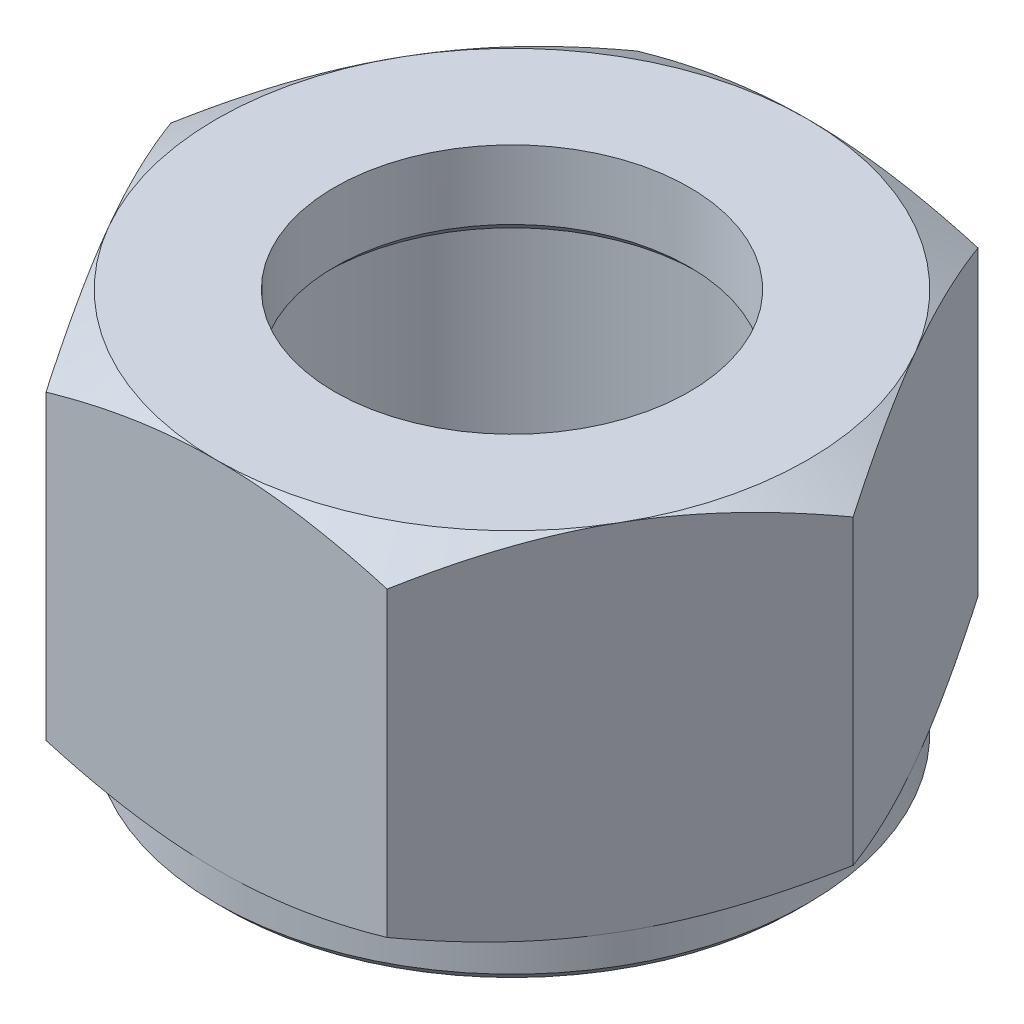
ISO-10303-21;
HEADER;
FILE_DESCRIPTION(('STEP AP214'),'2;1');
FILE_NAME('part.step','',(''),(''),'','','');
FILE_SCHEMA(('AUTOMOTIVE_DESIGN { 1 0 10303 214 1 1 1 1 }'));
ENDSEC;
DATA;
#1=APPLICATION_CONTEXT('core data for automotive mechanical design processes');
#2=APPLICATION_PROTOCOL_DEFINITION('international standard','automotive_design',2000,#1);
#3=PRODUCT_CONTEXT('',#1,'mechanical');
#4=PRODUCT('Part','Part','',(#3));
#5=PRODUCT_RELATED_PRODUCT_CATEGORY('part','',(#4));
#6=PRODUCT_DEFINITION_FORMATION('','',#4);
#7=PRODUCT_DEFINITION_CONTEXT('part definition',#1,'design');
#8=PRODUCT_DEFINITION('design','',#6,#7);
#9=PRODUCT_DEFINITION_SHAPE('','',#8);
#10=(LENGTH_UNIT() NAMED_UNIT(*) SI_UNIT(.MILLI.,.METRE.));
#11=(NAMED_UNIT(*) PLANE_ANGLE_UNIT() SI_UNIT($,.RADIAN.));
#12=(NAMED_UNIT(*) SI_UNIT($,.STERADIAN.) SOLID_ANGLE_UNIT());
#13=UNCERTAINTY_MEASURE_WITH_UNIT(LENGTH_MEASURE(1.E-05),#10,'distance_accuracy_value','');
#14=(GEOMETRIC_REPRESENTATION_CONTEXT(3) GLOBAL_UNCERTAINTY_ASSIGNED_CONTEXT((#13)) GLOBAL_UNIT_ASSIGNED_CONTEXT((#10,
#11,#12)) REPRESENTATION_CONTEXT('',''));
#15=CARTESIAN_POINT('',(0.,0.,0.));
#16=DIRECTION('',(0.,0.,1.));
#17=DIRECTION('',(1.,0.,0.));
#18=AXIS2_PLACEMENT_3D('',#15,#16,#17);
#19=CARTESIAN_POINT('',(8.66025403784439,18.,15.));
#20=DIRECTION('',(-0.866025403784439,0.,-0.5));
#21=DIRECTION('',(-0.5,0.,0.866025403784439));
#22=AXIS2_PLACEMENT_3D('',#19,#20,#21);
#23=PLANE('',#22);
#24=CARTESIAN_POINT('',(17.3206235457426,1.33981262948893,-0.000200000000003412));
#25=CARTESIAN_POINT('',(17.130274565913,1.22992178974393,0.329494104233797));
#26=CARTESIAN_POINT('',(16.939183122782,1.1250175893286,0.660474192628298));
#27=CARTESIAN_POINT('',(16.5554679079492,0.926568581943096,1.32508844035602));
#28=CARTESIAN_POINT('',(16.3628436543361,0.833027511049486,1.6587234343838));
#29=CARTESIAN_POINT('',(15.9756905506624,0.658562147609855,2.32929228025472));
#30=CARTESIAN_POINT('',(15.7811583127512,0.577667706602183,2.66623200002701));
#31=CARTESIAN_POINT('',(15.3907420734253,0.430232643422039,3.34245276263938));
#32=CARTESIAN_POINT('',(15.1948581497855,0.363691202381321,3.68173367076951));
#33=CARTESIAN_POINT('',(14.8067578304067,0.247792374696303,4.35394314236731));
#34=CARTESIAN_POINT('',(14.6145702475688,0.19805138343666,4.68682180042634));
#35=CARTESIAN_POINT('',(14.2293144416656,0.114646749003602,5.35410443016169));
#36=CARTESIAN_POINT('',(14.0362462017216,0.0809834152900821,5.68850843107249));
#37=CARTESIAN_POINT('',(13.6497853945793,0.0305840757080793,6.35787818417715));
#38=CARTESIAN_POINT('',(13.4563934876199,0.0138279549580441,6.69284279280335));
#39=CARTESIAN_POINT('',(13.0694311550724,-0.00239660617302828,7.36308121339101));
#40=CARTESIAN_POINT('',(12.8758607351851,-0.00186558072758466,7.69835501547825));
#41=CARTESIAN_POINT('',(12.5139822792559,0.0152766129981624,8.32514688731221));
#42=CARTESIAN_POINT('',(12.3456484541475,0.0297968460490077,8.61670962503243));
#43=CARTESIAN_POINT('',(12.0093680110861,0.0716371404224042,9.19916443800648));
#44=CARTESIAN_POINT('',(11.8414214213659,0.0989581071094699,9.49005646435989));
#45=CARTESIAN_POINT('',(11.5060066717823,0.165923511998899,10.0710118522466));
#46=CARTESIAN_POINT('',(11.338539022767,0.205578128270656,10.3610743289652));
#47=CARTESIAN_POINT('',(11.0043888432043,0.296515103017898,10.939839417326));
#48=CARTESIAN_POINT('',(10.8377063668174,0.347798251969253,11.2285419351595));
#49=CARTESIAN_POINT('',(10.3317324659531,0.520386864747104,12.1049144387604));
#50=CARTESIAN_POINT('',(9.99390625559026,0.658901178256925,12.6900465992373));
#51=CARTESIAN_POINT('',(9.32329122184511,0.973271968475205,13.8515859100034));
#52=CARTESIAN_POINT('',(8.99049381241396,1.14905461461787,14.4280079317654));
#53=CARTESIAN_POINT('',(8.66013856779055,1.33981262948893,15.0002));
#54=B_SPLINE_CURVE_WITH_KNOTS('',3,(#24,#25,#26,#27,#28,#29,#30,#31,#32,#33,#34,#35,#36,#37,#38,
#39,#40,#41,#42,#43,#44,#45,#46,#47,#48,#49,#50,#51,#52,#53),.UNSPECIFIED.,.F.,.F.,(4,2,2,2,2,2,
2,2,2,2,2,2,2,2,4),(0.,1.18875411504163,2.37789802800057,3.56980778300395,4.76164951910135,
5.92407379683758,7.08652044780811,8.24758247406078,9.40860862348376,10.4193068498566,
11.4300765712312,12.4416826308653,13.4533574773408,15.5211962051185,17.5849760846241),.UNSPECIFIED.);
#55=CARTESIAN_POINT('',(17.3205080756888,1.3397459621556,0.));
#56=VERTEX_POINT('',#55);
#57=CARTESIAN_POINT('',(12.9903810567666,0.,7.50000000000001));
#58=VERTEX_POINT('',#57);
#59=EDGE_CURVE('E571',#56,#58,#54,.T.);
#60=ORIENTED_EDGE('',*,*,#59,.F.);
#61=DIRECTION('',(0.,-1.,0.));
#62=VECTOR('',#61,1.);
#63=CARTESIAN_POINT('',(17.3205080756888,18.,0.));
#64=LINE('',#63,#62);
#65=CARTESIAN_POINT('',(17.3205080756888,16.6602540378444,0.));
#66=VERTEX_POINT('',#65);
#67=EDGE_CURVE('E533',#66,#56,#64,.T.);
#68=ORIENTED_EDGE('',*,*,#67,.F.);
#69=CARTESIAN_POINT('',(8.66013856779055,16.6601873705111,15.0002));
#70=CARTESIAN_POINT('',(8.85048754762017,16.7700782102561,14.6705058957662));
#71=CARTESIAN_POINT('',(9.04157899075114,16.8749824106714,14.3395258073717));
#72=CARTESIAN_POINT('',(9.425294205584,17.0734314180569,13.674911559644));
#73=CARTESIAN_POINT('',(9.61791845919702,17.1669724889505,13.3412765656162));
#74=CARTESIAN_POINT('',(10.0050715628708,17.3414378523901,12.6707077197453));
#75=CARTESIAN_POINT('',(10.199603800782,17.4223322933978,12.333767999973));
#76=CARTESIAN_POINT('',(10.5900200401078,17.569767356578,11.6575472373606));
#77=CARTESIAN_POINT('',(10.7859039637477,17.6363087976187,11.3182663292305));
#78=CARTESIAN_POINT('',(11.1740042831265,17.7522076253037,10.6460568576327));
#79=CARTESIAN_POINT('',(11.3661918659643,17.8019486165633,10.3131781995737));
#80=CARTESIAN_POINT('',(11.7514476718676,17.8853532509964,9.64589556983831));
#81=CARTESIAN_POINT('',(11.9445159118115,17.9190165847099,9.31149156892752));
#82=CARTESIAN_POINT('',(12.3309767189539,17.9694159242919,8.64212181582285));
#83=CARTESIAN_POINT('',(12.5243686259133,17.9861720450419,8.30715720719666));
#84=CARTESIAN_POINT('',(12.9113309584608,18.002396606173,7.636918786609));
#85=CARTESIAN_POINT('',(13.1049013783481,18.0018655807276,7.30164498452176));
#86=CARTESIAN_POINT('',(13.4667798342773,17.9847233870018,6.6748531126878));
#87=CARTESIAN_POINT('',(13.6351136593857,17.970203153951,6.38329037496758));
#88=CARTESIAN_POINT('',(13.9713941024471,17.9283628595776,5.80083556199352));
#89=CARTESIAN_POINT('',(14.1393406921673,17.9010418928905,5.50994353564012));
#90=CARTESIAN_POINT('',(14.4747554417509,17.8340764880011,4.92898814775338));
#91=CARTESIAN_POINT('',(14.6422230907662,17.7944218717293,4.63892567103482));
#92=CARTESIAN_POINT('',(14.9763732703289,17.7034848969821,4.06016058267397));
#93=CARTESIAN_POINT('',(15.1430557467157,17.6522017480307,3.77145806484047));
#94=CARTESIAN_POINT('',(15.6490296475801,17.4796131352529,2.89508556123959));
#95=CARTESIAN_POINT('',(15.9868558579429,17.3410988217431,2.30995340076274));
#96=CARTESIAN_POINT('',(16.6574708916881,17.0267280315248,1.14841408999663));
#97=CARTESIAN_POINT('',(16.9902683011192,16.8509453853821,0.571992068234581));
#98=CARTESIAN_POINT('',(17.3206235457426,16.6601873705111,-0.000200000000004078));
#99=B_SPLINE_CURVE_WITH_KNOTS('',3,(#69,#70,#71,#72,#73,#74,#75,#76,#77,#78,#79,#80,#81,#82,#83,
#84,#85,#86,#87,#88,#89,#90,#91,#92,#93,#94,#95,#96,#97,#98),.UNSPECIFIED.,.F.,.F.,(4,2,2,2,2,2,
2,2,2,2,2,2,2,2,4),(0.,1.18875411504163,2.37789802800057,3.56980778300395,4.76164951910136,
5.92407379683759,7.08652044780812,8.24758247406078,9.40860862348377,10.4193068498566,
11.4300765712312,12.4416826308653,13.4533574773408,15.5211962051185,17.5849760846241),.UNSPECIFIED.);
#100=CARTESIAN_POINT('',(12.9903810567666,18.,7.5));
#101=VERTEX_POINT('',#100);
#102=EDGE_CURVE('E248',#101,#66,#99,.T.);
#103=ORIENTED_EDGE('',*,*,#102,.F.);
#104=CARTESIAN_POINT('',(8.66025403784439,16.6602540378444,15.));
#105=VERTEX_POINT('',#104);
#106=EDGE_CURVE('E530',#105,#101,#99,.T.);
#107=ORIENTED_EDGE('',*,*,#106,.F.);
#108=DIRECTION('',(0.,-1.,0.));
#109=VECTOR('',#108,1.);
#110=CARTESIAN_POINT('',(8.66025403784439,18.,15.));
#111=LINE('',#110,#109);
#112=CARTESIAN_POINT('',(8.66025403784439,1.3397459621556,15.));
#113=VERTEX_POINT('',#112);
#114=EDGE_CURVE('E535',#105,#113,#111,.T.);
#115=ORIENTED_EDGE('',*,*,#114,.T.);
#116=EDGE_CURVE('E207',#58,#113,#54,.T.);
#117=ORIENTED_EDGE('',*,*,#116,.F.);
#118=EDGE_LOOP('',(#60,#68,#103,#107,#115,#117));
#119=FACE_BOUND('',#118,.T.);
#120=ADVANCED_FACE('F39',(#119),#23,.F.);
#121=CARTESIAN_POINT('',(17.3205080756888,18.,0.));
#122=DIRECTION('',(-0.866025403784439,0.,0.5));
#123=DIRECTION('',(0.5,0.,0.866025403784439));
#124=AXIS2_PLACEMENT_3D('',#121,#122,#123);
#125=PLANE('',#124);
#126=CARTESIAN_POINT('',(8.66013856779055,1.33981262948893,-15.0002));
#127=CARTESIAN_POINT('',(8.85048754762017,1.22992178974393,-14.6705058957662));
#128=CARTESIAN_POINT('',(9.04157899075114,1.12501758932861,-14.3395258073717));
#129=CARTESIAN_POINT('',(9.425294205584,0.9265685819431,-13.674911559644));
#130=CARTESIAN_POINT('',(9.61791845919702,0.833027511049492,-13.3412765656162));
#131=CARTESIAN_POINT('',(10.0050715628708,0.658562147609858,-12.6707077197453));
#132=CARTESIAN_POINT('',(10.199603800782,0.577667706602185,-12.333767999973));
#133=CARTESIAN_POINT('',(10.5900200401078,0.43023264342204,-11.6575472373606));
#134=CARTESIAN_POINT('',(10.7859039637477,0.363691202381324,-11.3182663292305));
#135=CARTESIAN_POINT('',(11.1740042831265,0.247792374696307,-10.6460568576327));
#136=CARTESIAN_POINT('',(11.3661918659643,0.198051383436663,-10.3131781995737));
#137=CARTESIAN_POINT('',(11.7514476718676,0.114646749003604,-9.64589556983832));
#138=CARTESIAN_POINT('',(11.9445159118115,0.0809834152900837,-9.31149156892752));
#139=CARTESIAN_POINT('',(12.3309767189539,0.0305840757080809,-8.64212181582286));
#140=CARTESIAN_POINT('',(12.5243686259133,0.0138279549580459,-8.30715720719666));
#141=CARTESIAN_POINT('',(12.9113309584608,-0.00239660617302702,-7.63691878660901));
#142=CARTESIAN_POINT('',(13.1049013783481,-0.00186558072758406,-7.30164498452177));
#143=CARTESIAN_POINT('',(13.4667798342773,0.0152766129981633,-6.67485311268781));
#144=CARTESIAN_POINT('',(13.6351136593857,0.0297968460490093,-6.38329037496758));
#145=CARTESIAN_POINT('',(13.9713941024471,0.0716371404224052,-5.80083556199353));
#146=CARTESIAN_POINT('',(14.1393406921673,0.0989581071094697,-5.50994353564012));
#147=CARTESIAN_POINT('',(14.4747554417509,0.165923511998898,-4.92898814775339));
#148=CARTESIAN_POINT('',(14.6422230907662,0.205578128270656,-4.63892567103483));
#149=CARTESIAN_POINT('',(14.9763732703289,0.296515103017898,-4.06016058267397));
#150=CARTESIAN_POINT('',(15.1430557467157,0.347798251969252,-3.77145806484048));
#151=CARTESIAN_POINT('',(15.6490296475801,0.5203868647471,-2.8950855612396));
#152=CARTESIAN_POINT('',(15.9868558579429,0.658901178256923,-2.30995340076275));
#153=CARTESIAN_POINT('',(16.6574708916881,0.973271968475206,-1.14841408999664));
#154=CARTESIAN_POINT('',(16.9902683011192,1.14905461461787,-0.571992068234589));
#155=CARTESIAN_POINT('',(17.3206235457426,1.33981262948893,0.000199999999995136));
#156=B_SPLINE_CURVE_WITH_KNOTS('',3,(#126,#127,#128,#129,#130,#131,#132,#133,#134,#135,#136,
#137,#138,#139,#140,#141,#142,#143,#144,#145,#146,#147,#148,#149,#150,#151,#152,#153,#154,#155),
.UNSPECIFIED.,.F.,.F.,(4,2,2,2,2,2,2,2,2,2,2,2,2,2,4),(0.,1.18875411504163,2.37789802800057,
3.56980778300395,4.76164951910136,5.92407379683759,7.08652044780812,8.24758247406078,
9.40860862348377,10.4193068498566,11.4300765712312,12.4416826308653,13.4533574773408,
15.5211962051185,17.5849760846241),.UNSPECIFIED.);
#157=CARTESIAN_POINT('',(8.66025403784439,1.33974596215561,-15.));
#158=VERTEX_POINT('',#157);
#159=CARTESIAN_POINT('',(12.9903810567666,0.,-7.5));
#160=VERTEX_POINT('',#159);
#161=EDGE_CURVE('E154',#158,#160,#156,.T.);
#162=ORIENTED_EDGE('',*,*,#161,.F.);
#163=DIRECTION('',(0.,-1.,0.));
#164=VECTOR('',#163,1.);
#165=CARTESIAN_POINT('',(8.66025403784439,18.,-15.));
#166=LINE('',#165,#164);
#167=CARTESIAN_POINT('',(8.66025403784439,16.6602540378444,-15.));
#168=VERTEX_POINT('',#167);
#169=EDGE_CURVE('E162',#168,#158,#166,.T.);
#170=ORIENTED_EDGE('',*,*,#169,.F.);
#171=CARTESIAN_POINT('',(17.3206235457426,16.6601873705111,0.000199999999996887));
#172=CARTESIAN_POINT('',(17.130274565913,16.7700782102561,-0.329494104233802));
#173=CARTESIAN_POINT('',(16.939183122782,16.8749824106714,-0.660474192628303));
#174=CARTESIAN_POINT('',(16.5554679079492,17.0734314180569,-1.32508844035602));
#175=CARTESIAN_POINT('',(16.3628436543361,17.1669724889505,-1.65872343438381));
#176=CARTESIAN_POINT('',(15.9756905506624,17.3414378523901,-2.32929228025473));
#177=CARTESIAN_POINT('',(15.7811583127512,17.4223322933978,-2.66623200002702));
#178=CARTESIAN_POINT('',(15.3907420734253,17.569767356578,-3.34245276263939));
#179=CARTESIAN_POINT('',(15.1948581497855,17.6363087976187,-3.68173367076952));
#180=CARTESIAN_POINT('',(14.8067578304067,17.7522076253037,-4.35394314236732));
#181=CARTESIAN_POINT('',(14.6145702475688,17.8019486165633,-4.68682180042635));
#182=CARTESIAN_POINT('',(14.2293144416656,17.8853532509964,-5.3541044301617));
#183=CARTESIAN_POINT('',(14.0362462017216,17.9190165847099,-5.6885084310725));
#184=CARTESIAN_POINT('',(13.6497853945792,17.9694159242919,-6.35787818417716));
#185=CARTESIAN_POINT('',(13.4563934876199,17.9861720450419,-6.69284279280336));
#186=CARTESIAN_POINT('',(13.0694311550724,18.002396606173,-7.36308121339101));
#187=CARTESIAN_POINT('',(12.8758607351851,18.0018655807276,-7.69835501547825));
#188=CARTESIAN_POINT('',(12.5139822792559,17.9847233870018,-8.32514688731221));
#189=CARTESIAN_POINT('',(12.3456484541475,17.970203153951,-8.61670962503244));
#190=CARTESIAN_POINT('',(12.0093680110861,17.9283628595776,-9.19916443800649));
#191=CARTESIAN_POINT('',(11.8414214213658,17.9010418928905,-9.4900564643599));
#192=CARTESIAN_POINT('',(11.5060066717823,17.8340764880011,-10.0710118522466));
#193=CARTESIAN_POINT('',(11.338539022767,17.7944218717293,-10.3610743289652));
#194=CARTESIAN_POINT('',(11.0043888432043,17.7034848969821,-10.9398394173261));
#195=CARTESIAN_POINT('',(10.8377063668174,17.6522017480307,-11.2285419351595));
#196=CARTESIAN_POINT('',(10.3317324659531,17.4796131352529,-12.1049144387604));
#197=CARTESIAN_POINT('',(9.99390625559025,17.3410988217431,-12.6900465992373));
#198=CARTESIAN_POINT('',(9.3232912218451,17.0267280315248,-13.8515859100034));
#199=CARTESIAN_POINT('',(8.99049381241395,16.8509453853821,-14.4280079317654));
#200=CARTESIAN_POINT('',(8.66013856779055,16.6601873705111,-15.0002));
#201=B_SPLINE_CURVE_WITH_KNOTS('',3,(#171,#172,#173,#174,#175,#176,#177,#178,#179,#180,#181,
#182,#183,#184,#185,#186,#187,#188,#189,#190,#191,#192,#193,#194,#195,#196,#197,#198,#199,#200),
.UNSPECIFIED.,.F.,.F.,(4,2,2,2,2,2,2,2,2,2,2,2,2,2,4),(0.,1.18875411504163,2.37789802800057,
3.56980778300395,4.76164951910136,5.92407379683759,7.08652044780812,8.24758247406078,
9.40860862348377,10.4193068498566,11.4300765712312,12.4416826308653,13.4533574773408,
15.5211962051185,17.5849760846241),.UNSPECIFIED.);
#202=CARTESIAN_POINT('',(12.9903810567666,18.,-7.5));
#203=VERTEX_POINT('',#202);
#204=EDGE_CURVE('E242',#203,#168,#201,.T.);
#205=ORIENTED_EDGE('',*,*,#204,.F.);
#206=EDGE_CURVE('E247',#66,#203,#201,.T.);
#207=ORIENTED_EDGE('',*,*,#206,.F.);
#208=ORIENTED_EDGE('',*,*,#67,.T.);
#209=EDGE_CURVE('E172',#160,#56,#156,.T.);
#210=ORIENTED_EDGE('',*,*,#209,.F.);
#211=EDGE_LOOP('',(#162,#170,#205,#207,#208,#210));
#212=FACE_BOUND('',#211,.T.);
#213=ADVANCED_FACE('F253',(#212),#125,.F.);
#214=CARTESIAN_POINT('',(8.66025403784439,18.,-15.));
#215=DIRECTION('',(0.,0.,1.));
#216=DIRECTION('',(1.,0.,0.));
#217=AXIS2_PLACEMENT_3D('',#214,#215,#216);
#218=PLANE('',#217);
#219=CARTESIAN_POINT('',(-23.3393940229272,7.35772870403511,-15.));
#220=CARTESIAN_POINT('',(-23.0114053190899,7.1984305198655,-15.));
#221=CARTESIAN_POINT('',(-22.6830336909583,7.03992113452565,-15.));
#222=CARTESIAN_POINT('',(-22.0254446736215,6.72465852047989,-15.));
#223=CARTESIAN_POINT('',(-21.6962272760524,6.56790530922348,-15.));
#224=CARTESIAN_POINT('',(-20.7070998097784,6.10050689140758,-15.));
#225=CARTESIAN_POINT('',(-20.0458104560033,5.79276964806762,-15.));
#226=CARTESIAN_POINT('',(-18.7152703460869,5.18525804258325,-15.));
#227=CARTESIAN_POINT('',(-18.0459958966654,4.88553544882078,-15.));
#228=CARTESIAN_POINT('',(-16.7021489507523,4.29825531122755,-15.));
#229=CARTESIAN_POINT('',(-16.0275767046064,4.01069719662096,-15.));
#230=CARTESIAN_POINT('',(-14.65041648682,3.44202642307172,-15.));
#231=CARTESIAN_POINT('',(-13.9476215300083,3.16141243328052,-15.));
#232=CARTESIAN_POINT('',(-12.5338342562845,2.62123584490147,-15.));
#233=CARTESIAN_POINT('',(-11.8228410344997,2.36167559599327,-15.));
#234=CARTESIAN_POINT('',(-10.3928529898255,1.87036497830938,-15.));
#235=CARTESIAN_POINT('',(-9.67387739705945,1.63855908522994,-15.));
#236=CARTESIAN_POINT('',(-8.22554789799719,1.21012903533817,-15.));
#237=CARTESIAN_POINT('',(-7.49619731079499,1.01349388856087,-15.));
#238=CARTESIAN_POINT('',(-6.39616851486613,0.752505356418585,-15.));
#239=CARTESIAN_POINT('',(-6.02945591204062,0.671337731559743,-15.));
#240=CARTESIAN_POINT('',(-5.29351072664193,0.521298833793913,-15.));
#241=CARTESIAN_POINT('',(-4.92427819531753,0.452427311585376,-15.));
#242=CARTESIAN_POINT('',(-4.1835438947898,0.328191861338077,-15.));
#243=CARTESIAN_POINT('',(-3.81204217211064,0.272827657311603,-15.));
#244=CARTESIAN_POINT('',(-3.06715672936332,0.176708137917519,-15.));
#245=CARTESIAN_POINT('',(-2.69377309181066,0.135952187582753,-15.));
#246=CARTESIAN_POINT('',(-1.95055361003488,0.0703738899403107,-15.));
#247=CARTESIAN_POINT('',(-1.58073575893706,0.045348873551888,-15.));
#248=CARTESIAN_POINT('',(-0.840373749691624,0.0109645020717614,-15.));
#249=CARTESIAN_POINT('',(-0.469829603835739,0.00160488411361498,-15.));
#250=CARTESIAN_POINT('',(0.271329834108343,-0.00122574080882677,-15.));
#251=CARTESIAN_POINT('',(0.641945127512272,0.00530358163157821,-15.));
#252=CARTESIAN_POINT('',(1.38256736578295,0.034090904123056,-15.));
#253=CARTESIAN_POINT('',(1.75257428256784,0.0563496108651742,-15.));
#254=CARTESIAN_POINT('',(2.63914919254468,0.128055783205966,-15.));
#255=CARTESIAN_POINT('',(3.15513827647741,0.184817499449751,-15.));
#256=CARTESIAN_POINT('',(4.18331580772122,0.325854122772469,-15.));
#257=CARTESIAN_POINT('',(4.6955037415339,0.410132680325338,-15.));
#258=CARTESIAN_POINT('',(6.22573209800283,0.699775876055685,-15.));
#259=CARTESIAN_POINT('',(7.23690824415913,0.941899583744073,-15.));
#260=CARTESIAN_POINT('',(8.7496746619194,1.36230448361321,-15.));
#261=CARTESIAN_POINT('',(9.25908594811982,1.51406195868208,-15.));
#262=CARTESIAN_POINT('',(10.2729574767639,1.83344648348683,-15.));
#263=CARTESIAN_POINT('',(10.7774176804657,2.00107365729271,-15.));
#264=CARTESIAN_POINT('',(11.7815583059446,2.34950036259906,-15.));
#265=CARTESIAN_POINT('',(12.2812401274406,2.53029589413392,-15.));
#266=CARTESIAN_POINT('',(13.0276432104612,2.80976049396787,-15.));
#267=CARTESIAN_POINT('',(13.2759225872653,2.90429322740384,-15.));
#268=CARTESIAN_POINT('',(13.7715052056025,3.09588586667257,-15.));
#269=CARTESIAN_POINT('',(14.0188084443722,3.19294577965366,-15.));
#270=CARTESIAN_POINT('',(14.7100541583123,3.46797636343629,-15.));
#271=CARTESIAN_POINT('',(15.1529688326,3.64853296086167,-15.));
#272=CARTESIAN_POINT('',(16.0361480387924,4.01602791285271,-15.));
#273=CARTESIAN_POINT('',(16.4764125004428,4.20296643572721,-15.));
#274=CARTESIAN_POINT('',(17.3546172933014,4.58232673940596,-15.));
#275=CARTESIAN_POINT('',(17.7925574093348,4.7747490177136,-15.));
#276=CARTESIAN_POINT('',(18.6663393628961,5.1643048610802,-15.));
#277=CARTESIAN_POINT('',(19.1021811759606,5.36143848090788,-15.));
#278=CARTESIAN_POINT('',(20.4072632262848,5.95907943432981,-15.));
#279=CARTESIAN_POINT('',(21.2737159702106,6.36567698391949,-15.));
#280=CARTESIAN_POINT('',(23.0006921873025,7.19111629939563,-15.));
#281=CARTESIAN_POINT('',(23.8612159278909,7.60995750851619,-15.));
#282=CARTESIAN_POINT('',(25.579007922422,8.45783443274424,-15.));
#283=CARTESIAN_POINT('',(26.4362683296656,8.88688601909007,-15.));
#284=CARTESIAN_POINT('',(28.1470099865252,9.75246441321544,-15.));
#285=CARTESIAN_POINT('',(29.0004912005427,10.1889912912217,-15.));
#286=CARTESIAN_POINT('',(30.7041763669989,11.067900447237,-15.));
#287=CARTESIAN_POINT('',(31.5543810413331,11.510281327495,-15.));
#288=CARTESIAN_POINT('',(33.2522578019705,12.3998643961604,-15.));
#289=CARTESIAN_POINT('',(34.0999298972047,12.8470665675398,-15.));
#290=CARTESIAN_POINT('',(36.4510001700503,14.0943921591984,-15.));
#291=CARTESIAN_POINT('',(37.9521489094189,14.8987545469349,-15.));
#292=CARTESIAN_POINT('',(40.9497293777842,16.5164409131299,-15.));
#293=CARTESIAN_POINT('',(42.4461607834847,17.3297654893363,-15.));
#294=CARTESIAN_POINT('',(45.4303198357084,18.9602846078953,-15.));
#295=CARTESIAN_POINT('',(46.9180597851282,19.7774566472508,-15.));
#296=CARTESIAN_POINT('',(49.1475221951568,21.006960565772,-15.));
#297=CARTESIAN_POINT('',(49.8902881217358,21.4174026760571,-15.));
#298=CARTESIAN_POINT('',(51.375200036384,22.2394049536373,-15.));
#299=CARTESIAN_POINT('',(52.1173460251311,22.6509651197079,-15.));
#300=CARTESIAN_POINT('',(52.8592206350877,23.0630140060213,-15.));
#301=B_SPLINE_CURVE_WITH_KNOTS('',3,(#219,#220,#221,#222,#223,#224,#225,#226,#227,#228,#229,
#230,#231,#232,#233,#234,#235,#236,#237,#238,#239,#240,#241,#242,#243,#244,#245,#246,#247,#248,
#249,#250,#251,#252,#253,#254,#255,#256,#257,#258,#259,#260,#261,#262,#263,#264,#265,#266,#267,
#268,#269,#270,#271,#272,#273,#274,#275,#276,#277,#278,#279,#280,#281,#282,#283,#284,#285,#286,
#287,#288,#289,#290,#291,#292,#293,#294,#295,#296,#297,#298,#299,#300),.UNSPECIFIED.,.F.,.F.,(4,
2,2,2,2,2,2,2,2,2,2,2,2,2,2,2,2,2,2,2,2,2,2,2,2,2,2,2,2,2,2,2,2,2,2,2,2,2,2,2,4),(0.,
1.09387761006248,2.18776607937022,4.37586329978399,6.57573652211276,8.77550640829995,
11.0454877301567,13.3157220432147,15.5813359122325,17.8462405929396,18.9728316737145,
20.0993999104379,21.225945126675,22.3524413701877,23.4641097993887,24.5757595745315,
25.6874323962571,26.7991551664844,28.3555836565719,29.912218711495,33.0270748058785,
34.6215460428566,36.2160297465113,37.8100311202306,38.6070207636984,39.404012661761,
40.8388587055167,42.2737426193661,43.708757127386,45.1437883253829,48.0149765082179,
50.8860343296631,53.7618915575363,56.6377758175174,59.5129853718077,62.3881847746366,
67.4973462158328,72.6068505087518,77.6990134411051,80.2448869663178,82.7907577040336),.UNSPECIFIED.);
#302=CARTESIAN_POINT('',(-8.6602540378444,1.33974596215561,-15.));
#303=VERTEX_POINT('',#302);
#304=CARTESIAN_POINT('',(0.,0.,-15.));
#305=VERTEX_POINT('',#304);
#306=EDGE_CURVE('E141',#303,#305,#301,.T.);
#307=ORIENTED_EDGE('',*,*,#306,.F.);
#308=DIRECTION('',(0.,-1.,0.));
#309=VECTOR('',#308,1.);
#310=CARTESIAN_POINT('',(-8.6602540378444,18.,-15.));
#311=LINE('',#310,#309);
#312=CARTESIAN_POINT('',(-8.6602540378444,16.6602540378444,-15.));
#313=VERTEX_POINT('',#312);
#314=EDGE_CURVE('E546',#313,#303,#311,.T.);
#315=ORIENTED_EDGE('',*,*,#314,.F.);
#316=CARTESIAN_POINT('',(-23.3393940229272,10.6422712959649,-15.));
#317=CARTESIAN_POINT('',(-23.0114053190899,10.8015694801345,-15.));
#318=CARTESIAN_POINT('',(-22.6830336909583,10.9600788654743,-15.));
#319=CARTESIAN_POINT('',(-22.0254446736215,11.2753414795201,-15.));
#320=CARTESIAN_POINT('',(-21.6962272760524,11.4320946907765,-15.));
#321=CARTESIAN_POINT('',(-20.7070998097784,11.8994931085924,-15.));
#322=CARTESIAN_POINT('',(-20.0458104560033,12.2072303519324,-15.));
#323=CARTESIAN_POINT('',(-18.7152703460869,12.8147419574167,-15.));
#324=CARTESIAN_POINT('',(-18.0459958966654,13.1144645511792,-15.));
#325=CARTESIAN_POINT('',(-16.7021489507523,13.7017446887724,-15.));
#326=CARTESIAN_POINT('',(-16.0275767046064,13.989302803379,-15.));
#327=CARTESIAN_POINT('',(-14.65041648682,14.5579735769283,-15.));
#328=CARTESIAN_POINT('',(-13.9476215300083,14.8385875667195,-15.));
#329=CARTESIAN_POINT('',(-12.5338342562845,15.3787641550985,-15.));
#330=CARTESIAN_POINT('',(-11.8228410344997,15.6383244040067,-15.));
#331=CARTESIAN_POINT('',(-10.3928529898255,16.1296350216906,-15.));
#332=CARTESIAN_POINT('',(-9.67387739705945,16.3614409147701,-15.));
#333=CARTESIAN_POINT('',(-8.22554789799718,16.7898709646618,-15.));
#334=CARTESIAN_POINT('',(-7.49619731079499,16.9865061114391,-15.));
#335=CARTESIAN_POINT('',(-6.39616851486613,17.2474946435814,-15.));
#336=CARTESIAN_POINT('',(-6.02945591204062,17.3286622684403,-15.));
#337=CARTESIAN_POINT('',(-5.29351072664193,17.4787011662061,-15.));
#338=CARTESIAN_POINT('',(-4.92427819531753,17.5475726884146,-15.));
#339=CARTESIAN_POINT('',(-4.1835438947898,17.6718081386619,-15.));
#340=CARTESIAN_POINT('',(-3.81204217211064,17.7271723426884,-15.));
#341=CARTESIAN_POINT('',(-3.06715672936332,17.8232918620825,-15.));
#342=CARTESIAN_POINT('',(-2.69377309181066,17.8640478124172,-15.));
#343=CARTESIAN_POINT('',(-1.95055361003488,17.9296261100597,-15.));
#344=CARTESIAN_POINT('',(-1.58073575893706,17.9546511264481,-15.));
#345=CARTESIAN_POINT('',(-0.840373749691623,17.9890354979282,-15.));
#346=CARTESIAN_POINT('',(-0.469829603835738,17.9983951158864,-15.));
#347=CARTESIAN_POINT('',(0.271329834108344,18.0012257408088,-15.));
#348=CARTESIAN_POINT('',(0.641945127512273,17.9946964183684,-15.));
#349=CARTESIAN_POINT('',(1.38256736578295,17.9659090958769,-15.));
#350=CARTESIAN_POINT('',(1.75257428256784,17.9436503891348,-15.));
#351=CARTESIAN_POINT('',(2.63914919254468,17.871944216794,-15.));
#352=CARTESIAN_POINT('',(3.15513827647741,17.8151825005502,-15.));
#353=CARTESIAN_POINT('',(4.18331580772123,17.6741458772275,-15.));
#354=CARTESIAN_POINT('',(4.6955037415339,17.5898673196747,-15.));
#355=CARTESIAN_POINT('',(6.22573209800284,17.3002241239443,-15.));
#356=CARTESIAN_POINT('',(7.23690824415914,17.0581004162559,-15.));
#357=CARTESIAN_POINT('',(8.7496746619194,16.6376955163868,-15.));
#358=CARTESIAN_POINT('',(9.25908594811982,16.4859380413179,-15.));
#359=CARTESIAN_POINT('',(10.2729574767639,16.1665535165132,-15.));
#360=CARTESIAN_POINT('',(10.7774176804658,15.9989263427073,-15.));
#361=CARTESIAN_POINT('',(11.7815583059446,15.6504996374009,-15.));
#362=CARTESIAN_POINT('',(12.2812401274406,15.4697041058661,-15.));
#363=CARTESIAN_POINT('',(13.0276432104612,15.1902395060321,-15.));
#364=CARTESIAN_POINT('',(13.2759225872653,15.0957067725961,-15.));
#365=CARTESIAN_POINT('',(13.7715052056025,14.9041141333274,-15.));
#366=CARTESIAN_POINT('',(14.0188084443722,14.8070542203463,-15.));
#367=CARTESIAN_POINT('',(14.7100541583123,14.5320236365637,-15.));
#368=CARTESIAN_POINT('',(15.1529688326,14.3514670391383,-15.));
#369=CARTESIAN_POINT('',(16.0361480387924,13.9839720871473,-15.));
#370=CARTESIAN_POINT('',(16.4764125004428,13.7970335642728,-15.));
#371=CARTESIAN_POINT('',(17.3546172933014,13.417673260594,-15.));
#372=CARTESIAN_POINT('',(17.7925574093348,13.2252509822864,-15.));
#373=CARTESIAN_POINT('',(18.6663393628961,12.8356951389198,-15.));
#374=CARTESIAN_POINT('',(19.1021811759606,12.6385615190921,-15.));
#375=CARTESIAN_POINT('',(20.4072632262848,12.0409205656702,-15.));
#376=CARTESIAN_POINT('',(21.2737159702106,11.6343230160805,-15.));
#377=CARTESIAN_POINT('',(23.0006921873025,10.8088837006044,-15.));
#378=CARTESIAN_POINT('',(23.8612159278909,10.3900424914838,-15.));
#379=CARTESIAN_POINT('',(25.579007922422,9.54216556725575,-15.));
#380=CARTESIAN_POINT('',(26.4362683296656,9.11311398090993,-15.));
#381=CARTESIAN_POINT('',(28.1470099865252,8.24753558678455,-15.));
#382=CARTESIAN_POINT('',(29.0004912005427,7.8110087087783,-15.));
#383=CARTESIAN_POINT('',(30.7041763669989,6.93209955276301,-15.));
#384=CARTESIAN_POINT('',(31.5543810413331,6.48971867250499,-15.));
#385=CARTESIAN_POINT('',(33.2522578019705,5.60013560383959,-15.));
#386=CARTESIAN_POINT('',(34.0999298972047,5.15293343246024,-15.));
#387=CARTESIAN_POINT('',(36.4510001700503,3.90560784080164,-15.));
#388=CARTESIAN_POINT('',(37.9521489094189,3.10124545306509,-15.));
#389=CARTESIAN_POINT('',(40.9497293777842,1.48355908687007,-15.));
#390=CARTESIAN_POINT('',(42.4461607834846,0.67023451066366,-15.));
#391=CARTESIAN_POINT('',(45.4303198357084,-0.960284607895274,-15.));
#392=CARTESIAN_POINT('',(46.9180597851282,-1.77745664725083,-15.));
#393=CARTESIAN_POINT('',(49.1475221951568,-3.00696056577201,-15.));
#394=CARTESIAN_POINT('',(49.8902881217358,-3.4174026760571,-15.));
#395=CARTESIAN_POINT('',(51.375200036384,-4.23940495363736,-15.));
#396=CARTESIAN_POINT('',(52.1173460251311,-4.65096511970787,-15.));
#397=CARTESIAN_POINT('',(52.8592206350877,-5.06301400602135,-15.));
#398=B_SPLINE_CURVE_WITH_KNOTS('',3,(#316,#317,#318,#319,#320,#321,#322,#323,#324,#325,#326,
#327,#328,#329,#330,#331,#332,#333,#334,#335,#336,#337,#338,#339,#340,#341,#342,#343,#344,#345,
#346,#347,#348,#349,#350,#351,#352,#353,#354,#355,#356,#357,#358,#359,#360,#361,#362,#363,#364,
#365,#366,#367,#368,#369,#370,#371,#372,#373,#374,#375,#376,#377,#378,#379,#380,#381,#382,#383,
#384,#385,#386,#387,#388,#389,#390,#391,#392,#393,#394,#395,#396,#397),.UNSPECIFIED.,.F.,.F.,(4,
2,2,2,2,2,2,2,2,2,2,2,2,2,2,2,2,2,2,2,2,2,2,2,2,2,2,2,2,2,2,2,2,2,2,2,2,2,2,2,4),(0.,
1.09387761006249,2.18776607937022,4.37586329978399,6.57573652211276,8.77550640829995,
11.0454877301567,13.3157220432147,15.5813359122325,17.8462405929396,18.9728316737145,
20.099399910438,21.2259451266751,22.3524413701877,23.4641097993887,24.5757595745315,
25.6874323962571,26.7991551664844,28.3555836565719,29.912218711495,33.0270748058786,
34.6215460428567,36.2160297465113,37.8100311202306,38.6070207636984,39.4040126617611,
40.8388587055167,42.2737426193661,43.708757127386,45.1437883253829,48.0149765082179,
50.8860343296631,53.7618915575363,56.6377758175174,59.5129853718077,62.3881847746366,
67.4973462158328,72.6068505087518,77.6990134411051,80.2448869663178,82.7907577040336),.UNSPECIFIED.);
#399=CARTESIAN_POINT('',(0.,18.,-15.));
#400=VERTEX_POINT('',#399);
#401=EDGE_CURVE('E236',#400,#313,#398,.F.);
#402=ORIENTED_EDGE('',*,*,#401,.F.);
#403=EDGE_CURVE('E241',#168,#400,#398,.F.);
#404=ORIENTED_EDGE('',*,*,#403,.F.);
#405=ORIENTED_EDGE('',*,*,#169,.T.);
#406=EDGE_CURVE('E149',#305,#158,#301,.T.);
#407=ORIENTED_EDGE('',*,*,#406,.F.);
#408=EDGE_LOOP('',(#307,#315,#402,#404,#405,#407));
#409=FACE_BOUND('',#408,.T.);
#410=ADVANCED_FACE('F159',(#409),#218,.F.);
#411=CARTESIAN_POINT('',(-8.6602540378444,18.,-15.));
#412=DIRECTION('',(0.866025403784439,0.,0.5));
#413=DIRECTION('',(0.5,0.,-0.866025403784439));
#414=AXIS2_PLACEMENT_3D('',#411,#412,#413);
#415=PLANE('',#414);
#416=CARTESIAN_POINT('',(-17.3206235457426,1.33981262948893,0.000200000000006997));
#417=CARTESIAN_POINT('',(-17.130274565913,1.22992178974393,-0.329494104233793));
#418=CARTESIAN_POINT('',(-16.939183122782,1.12501758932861,-0.660474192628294));
#419=CARTESIAN_POINT('',(-16.5554679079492,0.9265685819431,-1.32508844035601));
#420=CARTESIAN_POINT('',(-16.3628436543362,0.833027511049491,-1.6587234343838));
#421=CARTESIAN_POINT('',(-15.9756905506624,0.658562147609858,-2.32929228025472));
#422=CARTESIAN_POINT('',(-15.7811583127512,0.577667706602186,-2.66623200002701));
#423=CARTESIAN_POINT('',(-15.3907420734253,0.430232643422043,-3.34245276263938));
#424=CARTESIAN_POINT('',(-15.1948581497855,0.363691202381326,-3.68173367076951));
#425=CARTESIAN_POINT('',(-14.8067578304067,0.247792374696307,-4.35394314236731));
#426=CARTESIAN_POINT('',(-14.6145702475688,0.198051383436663,-4.68682180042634));
#427=CARTESIAN_POINT('',(-14.2293144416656,0.114646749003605,-5.35410443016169));
#428=CARTESIAN_POINT('',(-14.0362462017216,0.0809834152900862,-5.68850843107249));
#429=CARTESIAN_POINT('',(-13.6497853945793,0.0305840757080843,-6.35787818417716));
#430=CARTESIAN_POINT('',(-13.4563934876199,0.0138279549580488,-6.69284279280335));
#431=CARTESIAN_POINT('',(-13.0694311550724,-0.00239660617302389,-7.36308121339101));
#432=CARTESIAN_POINT('',(-12.8758607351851,-0.00186558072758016,-7.69835501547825));
#433=CARTESIAN_POINT('',(-12.5139822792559,0.0152766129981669,-8.32514688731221));
#434=CARTESIAN_POINT('',(-12.3456484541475,0.0297968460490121,-8.61670962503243));
#435=CARTESIAN_POINT('',(-12.0093680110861,0.071637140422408,-9.19916443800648));
#436=CARTESIAN_POINT('',(-11.8414214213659,0.0989581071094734,-9.49005646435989));
#437=CARTESIAN_POINT('',(-11.5060066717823,0.165923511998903,-10.0710118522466));
#438=CARTESIAN_POINT('',(-11.338539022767,0.205578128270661,-10.3610743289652));
#439=CARTESIAN_POINT('',(-11.0043888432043,0.296515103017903,-10.939839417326));
#440=CARTESIAN_POINT('',(-10.8377063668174,0.347798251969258,-11.2285419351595));
#441=CARTESIAN_POINT('',(-10.3317324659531,0.520386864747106,-12.1049144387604));
#442=CARTESIAN_POINT('',(-9.99390625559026,0.658901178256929,-12.6900465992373));
#443=CARTESIAN_POINT('',(-9.32329122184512,0.973271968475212,-13.8515859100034));
#444=CARTESIAN_POINT('',(-8.99049381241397,1.14905461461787,-14.4280079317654));
#445=CARTESIAN_POINT('',(-8.66013856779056,1.33981262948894,-15.0002));
#446=B_SPLINE_CURVE_WITH_KNOTS('',3,(#416,#417,#418,#419,#420,#421,#422,#423,#424,#425,#426,
#427,#428,#429,#430,#431,#432,#433,#434,#435,#436,#437,#438,#439,#440,#441,#442,#443,#444,#445),
.UNSPECIFIED.,.F.,.F.,(4,2,2,2,2,2,2,2,2,2,2,2,2,2,4),(0.,1.18875411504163,2.37789802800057,
3.56980778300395,4.76164951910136,5.92407379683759,7.08652044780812,8.24758247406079,
9.40860862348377,10.4193068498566,11.4300765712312,12.4416826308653,13.4533574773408,
15.5211962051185,17.5849760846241),.UNSPECIFIED.);
#447=CARTESIAN_POINT('',(-17.3205080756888,1.3397459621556,0.));
#448=VERTEX_POINT('',#447);
#449=CARTESIAN_POINT('',(-12.9903810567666,0.,-7.5));
#450=VERTEX_POINT('',#449);
#451=EDGE_CURVE('E164',#448,#450,#446,.T.);
#452=ORIENTED_EDGE('',*,*,#451,.F.);
#453=DIRECTION('',(0.,-1.,0.));
#454=VECTOR('',#453,1.);
#455=CARTESIAN_POINT('',(-17.3205080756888,18.,0.));
#456=LINE('',#455,#454);
#457=CARTESIAN_POINT('',(-17.3205080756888,16.6602540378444,0.));
#458=VERTEX_POINT('',#457);
#459=EDGE_CURVE('E548',#458,#448,#456,.T.);
#460=ORIENTED_EDGE('',*,*,#459,.F.);
#461=CARTESIAN_POINT('',(-8.66013856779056,16.6601873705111,-15.0002));
#462=CARTESIAN_POINT('',(-8.85048754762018,16.7700782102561,-14.6705058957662));
#463=CARTESIAN_POINT('',(-9.04157899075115,16.8749824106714,-14.3395258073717));
#464=CARTESIAN_POINT('',(-9.42529420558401,17.0734314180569,-13.674911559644));
#465=CARTESIAN_POINT('',(-9.61791845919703,17.1669724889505,-13.3412765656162));
#466=CARTESIAN_POINT('',(-10.0050715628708,17.3414378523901,-12.6707077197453));
#467=CARTESIAN_POINT('',(-10.199603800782,17.4223322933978,-12.333767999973));
#468=CARTESIAN_POINT('',(-10.5900200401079,17.569767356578,-11.6575472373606));
#469=CARTESIAN_POINT('',(-10.7859039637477,17.6363087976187,-11.3182663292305));
#470=CARTESIAN_POINT('',(-11.1740042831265,17.7522076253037,-10.6460568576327));
#471=CARTESIAN_POINT('',(-11.3661918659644,17.8019486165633,-10.3131781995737));
#472=CARTESIAN_POINT('',(-11.7514476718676,17.8853532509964,-9.64589556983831));
#473=CARTESIAN_POINT('',(-11.9445159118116,17.9190165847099,-9.31149156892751));
#474=CARTESIAN_POINT('',(-12.3309767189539,17.9694159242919,-8.64212181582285));
#475=CARTESIAN_POINT('',(-12.5243686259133,17.9861720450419,-8.30715720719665));
#476=CARTESIAN_POINT('',(-12.9113309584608,18.002396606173,-7.636918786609));
#477=CARTESIAN_POINT('',(-13.1049013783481,18.0018655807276,-7.30164498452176));
#478=CARTESIAN_POINT('',(-13.4667798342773,17.9847233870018,-6.6748531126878));
#479=CARTESIAN_POINT('',(-13.6351136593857,17.970203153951,-6.38329037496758));
#480=CARTESIAN_POINT('',(-13.9713941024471,17.9283628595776,-5.80083556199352));
#481=CARTESIAN_POINT('',(-14.1393406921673,17.9010418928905,-5.50994353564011));
#482=CARTESIAN_POINT('',(-14.4747554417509,17.8340764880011,-4.92898814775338));
#483=CARTESIAN_POINT('',(-14.6422230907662,17.7944218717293,-4.63892567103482));
#484=CARTESIAN_POINT('',(-14.9763732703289,17.7034848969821,-4.06016058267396));
#485=CARTESIAN_POINT('',(-15.1430557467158,17.6522017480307,-3.77145806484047));
#486=CARTESIAN_POINT('',(-15.6490296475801,17.4796131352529,-2.89508556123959));
#487=CARTESIAN_POINT('',(-15.9868558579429,17.3410988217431,-2.30995340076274));
#488=CARTESIAN_POINT('',(-16.6574708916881,17.0267280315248,-1.14841408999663));
#489=CARTESIAN_POINT('',(-16.9902683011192,16.8509453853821,-0.57199206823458));
#490=CARTESIAN_POINT('',(-17.3206235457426,16.6601873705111,0.000200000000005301));
#491=B_SPLINE_CURVE_WITH_KNOTS('',3,(#461,#462,#463,#464,#465,#466,#467,#468,#469,#470,#471,
#472,#473,#474,#475,#476,#477,#478,#479,#480,#481,#482,#483,#484,#485,#486,#487,#488,#489,#490),
.UNSPECIFIED.,.F.,.F.,(4,2,2,2,2,2,2,2,2,2,2,2,2,2,4),(0.,1.18875411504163,2.37789802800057,
3.56980778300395,4.76164951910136,5.92407379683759,7.08652044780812,8.24758247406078,
9.40860862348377,10.4193068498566,11.4300765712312,12.4416826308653,13.4533574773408,
15.5211962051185,17.5849760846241),.UNSPECIFIED.);
#492=CARTESIAN_POINT('',(-12.9903810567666,18.,-7.5));
#493=VERTEX_POINT('',#492);
#494=EDGE_CURVE('E224',#493,#458,#491,.T.);
#495=ORIENTED_EDGE('',*,*,#494,.F.);
#496=EDGE_CURVE('E230',#313,#493,#491,.T.);
#497=ORIENTED_EDGE('',*,*,#496,.F.);
#498=ORIENTED_EDGE('',*,*,#314,.T.);
#499=EDGE_CURVE('E143',#450,#303,#446,.T.);
#500=ORIENTED_EDGE('',*,*,#499,.F.);
#501=EDGE_LOOP('',(#452,#460,#495,#497,#498,#500));
#502=FACE_BOUND('',#501,.T.);
#503=ADVANCED_FACE('F216',(#502),#415,.F.);
#504=CARTESIAN_POINT('',(-17.3205080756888,18.,0.));
#505=DIRECTION('',(0.866025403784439,0.,-0.5));
#506=DIRECTION('',(-0.5,0.,-0.866025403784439));
#507=AXIS2_PLACEMENT_3D('',#504,#505,#506);
#508=PLANE('',#507);
#509=CARTESIAN_POINT('',(-8.66013856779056,1.33981262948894,15.0002));
#510=CARTESIAN_POINT('',(-8.85048754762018,1.22992178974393,14.6705058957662));
#511=CARTESIAN_POINT('',(-9.04157899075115,1.12501758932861,14.3395258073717));
#512=CARTESIAN_POINT('',(-9.42529420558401,0.9265685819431,13.674911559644));
#513=CARTESIAN_POINT('',(-9.61791845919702,0.833027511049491,13.3412765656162));
#514=CARTESIAN_POINT('',(-10.0050715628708,0.658562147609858,12.6707077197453));
#515=CARTESIAN_POINT('',(-10.199603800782,0.577667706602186,12.333767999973));
#516=CARTESIAN_POINT('',(-10.5900200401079,0.430232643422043,11.6575472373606));
#517=CARTESIAN_POINT('',(-10.7859039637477,0.363691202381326,11.3182663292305));
#518=CARTESIAN_POINT('',(-11.1740042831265,0.247792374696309,10.6460568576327));
#519=CARTESIAN_POINT('',(-11.3661918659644,0.198051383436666,10.3131781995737));
#520=CARTESIAN_POINT('',(-11.7514476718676,0.114646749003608,9.64589556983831));
#521=CARTESIAN_POINT('',(-11.9445159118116,0.0809834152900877,9.31149156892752));
#522=CARTESIAN_POINT('',(-12.3309767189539,0.0305840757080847,8.64212181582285));
#523=CARTESIAN_POINT('',(-12.5243686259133,0.0138279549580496,8.30715720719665));
#524=CARTESIAN_POINT('',(-12.9113309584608,-0.00239660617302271,7.636918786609));
#525=CARTESIAN_POINT('',(-13.1049013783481,-0.00186558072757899,7.30164498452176));
#526=CARTESIAN_POINT('',(-13.4667798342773,0.0152766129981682,6.6748531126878));
#527=CARTESIAN_POINT('',(-13.6351136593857,0.0297968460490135,6.38329037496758));
#528=CARTESIAN_POINT('',(-13.9713941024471,0.0716371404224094,5.80083556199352));
#529=CARTESIAN_POINT('',(-14.1393406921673,0.0989581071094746,5.50994353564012));
#530=CARTESIAN_POINT('',(-14.4747554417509,0.165923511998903,4.92898814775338));
#531=CARTESIAN_POINT('',(-14.6422230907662,0.205578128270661,4.63892567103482));
#532=CARTESIAN_POINT('',(-14.9763732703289,0.296515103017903,4.06016058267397));
#533=CARTESIAN_POINT('',(-15.1430557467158,0.347798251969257,3.77145806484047));
#534=CARTESIAN_POINT('',(-15.6490296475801,0.520386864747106,2.8950855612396));
#535=CARTESIAN_POINT('',(-15.9868558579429,0.658901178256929,2.30995340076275));
#536=CARTESIAN_POINT('',(-16.6574708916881,0.973271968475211,1.14841408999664));
#537=CARTESIAN_POINT('',(-16.9902683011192,1.14905461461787,0.571992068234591));
#538=CARTESIAN_POINT('',(-17.3206235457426,1.33981262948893,-0.000199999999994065));
#539=B_SPLINE_CURVE_WITH_KNOTS('',3,(#509,#510,#511,#512,#513,#514,#515,#516,#517,#518,#519,
#520,#521,#522,#523,#524,#525,#526,#527,#528,#529,#530,#531,#532,#533,#534,#535,#536,#537,#538),
.UNSPECIFIED.,.F.,.F.,(4,2,2,2,2,2,2,2,2,2,2,2,2,2,4),(0.,1.18875411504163,2.37789802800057,
3.56980778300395,4.76164951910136,5.92407379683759,7.08652044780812,8.24758247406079,
9.40860862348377,10.4193068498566,11.4300765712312,12.4416826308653,13.4533574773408,
15.5211962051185,17.5849760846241),.UNSPECIFIED.);
#540=CARTESIAN_POINT('',(-8.66025403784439,1.33974596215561,15.));
#541=VERTEX_POINT('',#540);
#542=CARTESIAN_POINT('',(-12.9903810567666,0.,7.50000000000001));
#543=VERTEX_POINT('',#542);
#544=EDGE_CURVE('E201',#541,#543,#539,.T.);
#545=ORIENTED_EDGE('',*,*,#544,.F.);
#546=DIRECTION('',(0.,-1.,0.));
#547=VECTOR('',#546,1.);
#548=CARTESIAN_POINT('',(-8.66025403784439,18.,15.));
#549=LINE('',#548,#547);
#550=CARTESIAN_POINT('',(-8.66025403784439,16.6602540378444,15.));
#551=VERTEX_POINT('',#550);
#552=EDGE_CURVE('E551',#551,#541,#549,.T.);
#553=ORIENTED_EDGE('',*,*,#552,.F.);
#554=CARTESIAN_POINT('',(-17.3206235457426,16.6601873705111,-0.000199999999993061));
#555=CARTESIAN_POINT('',(-17.130274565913,16.7700782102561,0.329494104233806));
#556=CARTESIAN_POINT('',(-16.939183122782,16.8749824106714,0.660474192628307));
#557=CARTESIAN_POINT('',(-16.5554679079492,17.0734314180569,1.32508844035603));
#558=CARTESIAN_POINT('',(-16.3628436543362,17.1669724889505,1.65872343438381));
#559=CARTESIAN_POINT('',(-15.9756905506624,17.3414378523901,2.32929228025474));
#560=CARTESIAN_POINT('',(-15.7811583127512,17.4223322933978,2.66623200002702));
#561=CARTESIAN_POINT('',(-15.3907420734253,17.569767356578,3.34245276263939));
#562=CARTESIAN_POINT('',(-15.1948581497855,17.6363087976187,3.68173367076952));
#563=CARTESIAN_POINT('',(-14.8067578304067,17.7522076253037,4.35394314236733));
#564=CARTESIAN_POINT('',(-14.6145702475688,17.8019486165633,4.68682180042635));
#565=CARTESIAN_POINT('',(-14.2293144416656,17.8853532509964,5.35410443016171));
#566=CARTESIAN_POINT('',(-14.0362462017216,17.9190165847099,5.68850843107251));
#567=CARTESIAN_POINT('',(-13.6497853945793,17.9694159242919,6.35787818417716));
#568=CARTESIAN_POINT('',(-13.4563934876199,17.9861720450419,6.69284279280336));
#569=CARTESIAN_POINT('',(-13.0694311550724,18.002396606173,7.36308121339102));
#570=CARTESIAN_POINT('',(-12.8758607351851,18.0018655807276,7.69835501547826));
#571=CARTESIAN_POINT('',(-12.5139822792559,17.9847233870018,8.32514688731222));
#572=CARTESIAN_POINT('',(-12.3456484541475,17.970203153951,8.61670962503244));
#573=CARTESIAN_POINT('',(-12.0093680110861,17.9283628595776,9.1991644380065));
#574=CARTESIAN_POINT('',(-11.8414214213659,17.9010418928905,9.4900564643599));
#575=CARTESIAN_POINT('',(-11.5060066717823,17.8340764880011,10.0710118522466));
#576=CARTESIAN_POINT('',(-11.338539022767,17.7944218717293,10.3610743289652));
#577=CARTESIAN_POINT('',(-11.0043888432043,17.7034848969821,10.939839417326));
#578=CARTESIAN_POINT('',(-10.8377063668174,17.6522017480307,11.2285419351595));
#579=CARTESIAN_POINT('',(-10.3317324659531,17.4796131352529,12.1049144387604));
#580=CARTESIAN_POINT('',(-9.99390625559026,17.3410988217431,12.6900465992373));
#581=CARTESIAN_POINT('',(-9.32329122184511,17.0267280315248,13.8515859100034));
#582=CARTESIAN_POINT('',(-8.99049381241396,16.8509453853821,14.4280079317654));
#583=CARTESIAN_POINT('',(-8.66013856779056,16.6601873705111,15.0002));
#584=B_SPLINE_CURVE_WITH_KNOTS('',3,(#554,#555,#556,#557,#558,#559,#560,#561,#562,#563,#564,
#565,#566,#567,#568,#569,#570,#571,#572,#573,#574,#575,#576,#577,#578,#579,#580,#581,#582,#583),
.UNSPECIFIED.,.F.,.F.,(4,2,2,2,2,2,2,2,2,2,2,2,2,2,4),(0.,1.18875411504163,2.37789802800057,
3.56980778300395,4.76164951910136,5.92407379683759,7.08652044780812,8.24758247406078,
9.40860862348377,10.4193068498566,11.4300765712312,12.4416826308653,13.4533574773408,
15.5211962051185,17.5849760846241),.UNSPECIFIED.);
#585=CARTESIAN_POINT('',(-12.9903810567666,18.,7.5));
#586=VERTEX_POINT('',#585);
#587=EDGE_CURVE('E232',#586,#551,#584,.T.);
#588=ORIENTED_EDGE('',*,*,#587,.F.);
#589=EDGE_CURVE('E231',#458,#586,#584,.T.);
#590=ORIENTED_EDGE('',*,*,#589,.F.);
#591=ORIENTED_EDGE('',*,*,#459,.T.);
#592=EDGE_CURVE('E215',#543,#448,#539,.T.);
#593=ORIENTED_EDGE('',*,*,#592,.F.);
#594=EDGE_LOOP('',(#545,#553,#588,#590,#591,#593));
#595=FACE_BOUND('',#594,.T.);
#596=ADVANCED_FACE('F219',(#595),#508,.F.);
#597=CARTESIAN_POINT('',(-8.66025403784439,18.,15.));
#598=DIRECTION('',(0.,0.,-1.));
#599=DIRECTION('',(-1.,0.,0.));
#600=AXIS2_PLACEMENT_3D('',#597,#598,#599);
#601=PLANE('',#600);
#602=CARTESIAN_POINT('',(-23.3393940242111,7.35772870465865,15.));
#603=CARTESIAN_POINT('',(-23.0114053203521,7.19843052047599,15.));
#604=CARTESIAN_POINT('',(-22.683033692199,7.0399211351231,15.));
#605=CARTESIAN_POINT('',(-22.0254446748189,6.72465852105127,15.));
#606=CARTESIAN_POINT('',(-21.6962272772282,6.56790530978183,15.));
#607=CARTESIAN_POINT('',(-20.7070998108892,6.1005068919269,15.));
#608=CARTESIAN_POINT('',(-20.0458104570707,5.79276964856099,15.));
#609=CARTESIAN_POINT('',(-18.7152703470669,5.18525804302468,15.));
#610=CARTESIAN_POINT('',(-18.0459958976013,4.88553544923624,15.));
#611=CARTESIAN_POINT('',(-16.7021489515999,4.29825531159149,15.));
#612=CARTESIAN_POINT('',(-16.0275767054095,4.01069719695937,15.));
#613=CARTESIAN_POINT('',(-14.6504164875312,3.44202642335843,15.));
#614=CARTESIAN_POINT('',(-13.9476215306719,3.16141243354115,15.));
#615=CARTESIAN_POINT('',(-12.5338342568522,2.6212358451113,15.));
#616=CARTESIAN_POINT('',(-11.822841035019,2.36167559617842,15.));
#617=CARTESIAN_POINT('',(-10.3928529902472,1.87036497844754,15.));
#618=CARTESIAN_POINT('',(-9.67387739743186,1.6385590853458,15.));
#619=CARTESIAN_POINT('',(-8.2255478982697,1.2101290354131,15.));
#620=CARTESIAN_POINT('',(-7.49619731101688,1.01349388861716,15.));
#621=CARTESIAN_POINT('',(-6.39616851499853,0.752505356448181,15.));
#622=CARTESIAN_POINT('',(-6.02945591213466,0.671337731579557,15.));
#623=CARTESIAN_POINT('',(-5.2935107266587,0.521298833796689,15.));
#624=CARTESIAN_POINT('',(-4.9242781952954,0.452427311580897,15.));
#625=CARTESIAN_POINT('',(-4.18354389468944,0.328191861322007,15.));
#626=CARTESIAN_POINT('',(-3.81204217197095,0.272827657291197,15.));
#627=CARTESIAN_POINT('',(-3.06715672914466,0.17670813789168,15.));
#628=CARTESIAN_POINT('',(-2.69377309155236,0.135952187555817,15.));
#629=CARTESIAN_POINT('',(-1.95055360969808,0.070373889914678,15.));
#630=CARTESIAN_POINT('',(-1.58073575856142,0.0453488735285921,15.));
#631=CARTESIAN_POINT('',(-0.8403737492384,0.0109645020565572,15.));
#632=CARTESIAN_POINT('',(-0.469829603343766,0.00160488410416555,15.));
#633=CARTESIAN_POINT('',(0.271329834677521,-0.00122574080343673,15.));
#634=CARTESIAN_POINT('',(0.641945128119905,0.00530358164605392,15.));
#635=CARTESIAN_POINT('',(1.38256736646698,0.0340909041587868,15.));
#636=CARTESIAN_POINT('',(1.75257428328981,0.0563496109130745,15.));
#637=CARTESIAN_POINT('',(2.63914919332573,0.128055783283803,15.));
#638=CARTESIAN_POINT('',(3.15513827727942,0.184817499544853,15.));
#639=CARTESIAN_POINT('',(4.18331580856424,0.325854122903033,15.));
#640=CARTESIAN_POINT('',(4.69550374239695,0.410132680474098,15.));
#641=CARTESIAN_POINT('',(6.22573209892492,0.699775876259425,15.));
#642=CARTESIAN_POINT('',(7.23690824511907,0.941899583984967,15.));
#643=CARTESIAN_POINT('',(8.74967466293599,1.36230448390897,15.));
#644=CARTESIAN_POINT('',(9.2590859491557,1.51406195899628,15.));
#645=CARTESIAN_POINT('',(10.2729574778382,1.83344648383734,15.));
#646=CARTESIAN_POINT('',(10.7774176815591,2.00107365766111,15.));
#647=CARTESIAN_POINT('',(11.781558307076,2.34950036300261,15.));
#648=CARTESIAN_POINT('',(12.2812401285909,2.53029589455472,15.));
#649=CARTESIAN_POINT('',(13.0276432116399,2.80976049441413,15.));
#650=CARTESIAN_POINT('',(13.2759225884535,2.90429322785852,15.));
#651=CARTESIAN_POINT('',(13.7715052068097,3.09588586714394,15.));
#652=CARTESIAN_POINT('',(14.0188084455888,3.1929457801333,15.));
#653=CARTESIAN_POINT('',(14.710054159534,3.46797636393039,15.));
#654=CARTESIAN_POINT('',(15.1529688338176,3.64853296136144,15.));
#655=CARTESIAN_POINT('',(16.0361480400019,4.01602791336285,15.));
#656=CARTESIAN_POINT('',(16.4764125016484,4.20296643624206,15.));
#657=CARTESIAN_POINT('',(17.3546172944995,4.58232673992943,15.));
#658=CARTESIAN_POINT('',(17.7925574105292,4.77474901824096,15.));
#659=CARTESIAN_POINT('',(18.6663393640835,5.1643048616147,15.));
#660=CARTESIAN_POINT('',(19.1021811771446,5.36143848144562,15.));
#661=CARTESIAN_POINT('',(20.4072632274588,5.95907943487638,15.));
#662=CARTESIAN_POINT('',(21.2737159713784,6.36567698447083,15.));
#663=CARTESIAN_POINT('',(23.0006921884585,7.19111629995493,15.));
#664=CARTESIAN_POINT('',(23.8612159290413,7.60995750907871,15.));
#665=CARTESIAN_POINT('',(25.5790079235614,8.45783443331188,15.));
#666=CARTESIAN_POINT('',(26.4362683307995,8.88688601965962,15.));
#667=CARTESIAN_POINT('',(28.1470099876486,9.75246441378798,15.));
#668=CARTESIAN_POINT('',(29.000491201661,10.1889912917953,15.));
#669=CARTESIAN_POINT('',(30.7041763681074,11.0679004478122,15.));
#670=CARTESIAN_POINT('',(31.554381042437,11.5102813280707,15.));
#671=CARTESIAN_POINT('',(33.2522578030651,12.3998643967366,15.));
#672=CARTESIAN_POINT('',(34.0999298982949,12.847066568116,15.));
#673=CARTESIAN_POINT('',(36.4510001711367,14.0943921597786,15.));
#674=CARTESIAN_POINT('',(37.9521489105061,14.8987545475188,15.));
#675=CARTESIAN_POINT('',(40.9497293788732,16.5164409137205,15.));
#676=CARTESIAN_POINT('',(42.4461607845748,17.3297654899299,15.));
#677=CARTESIAN_POINT('',(45.4303198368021,18.960284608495,15.));
#678=CARTESIAN_POINT('',(46.9180597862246,19.7774566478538,15.));
#679=CARTESIAN_POINT('',(49.1475221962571,21.0069605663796,15.));
#680=CARTESIAN_POINT('',(49.8902881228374,21.4174026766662,15.));
#681=CARTESIAN_POINT('',(51.3752000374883,22.2394049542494,15.));
#682=CARTESIAN_POINT('',(52.1173460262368,22.6509651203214,15.));
#683=CARTESIAN_POINT('',(52.8592206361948,23.0630140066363,15.));
#684=B_SPLINE_CURVE_WITH_KNOTS('',3,(#602,#603,#604,#605,#606,#607,#608,#609,#610,#611,#612,
#613,#614,#615,#616,#617,#618,#619,#620,#621,#622,#623,#624,#625,#626,#627,#628,#629,#630,#631,
#632,#633,#634,#635,#636,#637,#638,#639,#640,#641,#642,#643,#644,#645,#646,#647,#648,#649,#650,
#651,#652,#653,#654,#655,#656,#657,#658,#659,#660,#661,#662,#663,#664,#665,#666,#667,#668,#669,
#670,#671,#672,#673,#674,#675,#676,#677,#678,#679,#680,#681,#682,#683),.UNSPECIFIED.,.F.,.F.,(4,
2,2,2,2,2,2,2,2,2,2,2,2,2,2,2,2,2,2,2,2,2,2,2,2,2,2,2,2,2,2,2,2,2,2,2,2,2,2,2,4),(0.,
1.09387761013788,2.18776607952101,4.37586330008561,6.57573652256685,8.7755064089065,
11.0454877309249,13.3157220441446,15.5813359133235,17.8462405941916,18.9728316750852,
20.0993999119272,21.2259451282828,22.352441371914,23.4641098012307,24.5757595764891,
25.6874323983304,26.7991551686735,28.3555836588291,29.9122187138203,33.0270748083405,
34.6215460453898,36.2160297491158,37.8100311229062,38.6070207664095,39.4040126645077,
40.8388587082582,42.2737426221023,43.708757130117,45.1437883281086,48.0149765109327,
50.8860343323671,53.7618915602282,56.6377758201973,59.5129853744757,62.3881847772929,
67.4973462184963,72.6068505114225,77.6990134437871,80.2448869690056,82.790757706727),.UNSPECIFIED.);
#685=CARTESIAN_POINT('',(0.,0.,15.));
#686=VERTEX_POINT('',#685);
#687=EDGE_CURVE('E558',#113,#686,#684,.F.);
#688=ORIENTED_EDGE('',*,*,#687,.F.);
#689=ORIENTED_EDGE('',*,*,#114,.F.);
#690=CARTESIAN_POINT('',(-23.3393940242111,10.6422712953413,15.));
#691=CARTESIAN_POINT('',(-23.0114053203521,10.801569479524,15.));
#692=CARTESIAN_POINT('',(-22.683033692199,10.9600788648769,15.));
#693=CARTESIAN_POINT('',(-22.0254446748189,11.2753414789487,15.));
#694=CARTESIAN_POINT('',(-21.6962272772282,11.4320946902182,15.));
#695=CARTESIAN_POINT('',(-20.7070998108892,11.8994931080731,15.));
#696=CARTESIAN_POINT('',(-20.0458104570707,12.207230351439,15.));
#697=CARTESIAN_POINT('',(-18.7152703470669,12.8147419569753,15.));
#698=CARTESIAN_POINT('',(-18.0459958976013,13.1144645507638,15.));
#699=CARTESIAN_POINT('',(-16.7021489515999,13.7017446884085,15.));
#700=CARTESIAN_POINT('',(-16.0275767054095,13.9893028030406,15.));
#701=CARTESIAN_POINT('',(-14.6504164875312,14.5579735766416,15.));
#702=CARTESIAN_POINT('',(-13.9476215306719,14.8385875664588,15.));
#703=CARTESIAN_POINT('',(-12.5338342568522,15.3787641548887,15.));
#704=CARTESIAN_POINT('',(-11.822841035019,15.6383244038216,15.));
#705=CARTESIAN_POINT('',(-10.3928529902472,16.1296350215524,15.));
#706=CARTESIAN_POINT('',(-9.67387739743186,16.3614409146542,15.));
#707=CARTESIAN_POINT('',(-8.2255478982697,16.7898709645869,15.));
#708=CARTESIAN_POINT('',(-7.49619731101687,16.9865061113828,15.));
#709=CARTESIAN_POINT('',(-6.39616851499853,17.2474946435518,15.));
#710=CARTESIAN_POINT('',(-6.02945591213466,17.3286622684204,15.));
#711=CARTESIAN_POINT('',(-5.2935107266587,17.4787011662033,15.));
#712=CARTESIAN_POINT('',(-4.92427819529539,17.5475726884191,15.));
#713=CARTESIAN_POINT('',(-4.18354389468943,17.671808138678,15.));
#714=CARTESIAN_POINT('',(-3.81204217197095,17.7271723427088,15.));
#715=CARTESIAN_POINT('',(-3.06715672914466,17.8232918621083,15.));
#716=CARTESIAN_POINT('',(-2.69377309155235,17.8640478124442,15.));
#717=CARTESIAN_POINT('',(-1.95055360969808,17.9296261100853,15.));
#718=CARTESIAN_POINT('',(-1.58073575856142,17.9546511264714,15.));
#719=CARTESIAN_POINT('',(-0.840373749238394,17.9890354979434,15.));
#720=CARTESIAN_POINT('',(-0.469829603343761,17.9983951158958,15.));
#721=CARTESIAN_POINT('',(0.271329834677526,18.0012257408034,15.));
#722=CARTESIAN_POINT('',(0.641945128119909,17.9946964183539,15.));
#723=CARTESIAN_POINT('',(1.38256736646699,17.9659090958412,15.));
#724=CARTESIAN_POINT('',(1.75257428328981,17.9436503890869,15.));
#725=CARTESIAN_POINT('',(2.63914919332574,17.8719442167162,15.));
#726=CARTESIAN_POINT('',(3.15513827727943,17.8151825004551,15.));
#727=CARTESIAN_POINT('',(4.18331580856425,17.674145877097,15.));
#728=CARTESIAN_POINT('',(4.69550374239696,17.5898673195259,15.));
#729=CARTESIAN_POINT('',(6.22573209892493,17.3002241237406,15.));
#730=CARTESIAN_POINT('',(7.23690824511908,17.058100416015,15.));
#731=CARTESIAN_POINT('',(8.74967466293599,16.637695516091,15.));
#732=CARTESIAN_POINT('',(9.2590859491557,16.4859380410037,15.));
#733=CARTESIAN_POINT('',(10.2729574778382,16.1665535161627,15.));
#734=CARTESIAN_POINT('',(10.7774176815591,15.9989263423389,15.));
#735=CARTESIAN_POINT('',(11.781558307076,15.6504996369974,15.));
#736=CARTESIAN_POINT('',(12.2812401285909,15.4697041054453,15.));
#737=CARTESIAN_POINT('',(13.0276432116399,15.1902395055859,15.));
#738=CARTESIAN_POINT('',(13.2759225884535,15.0957067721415,15.));
#739=CARTESIAN_POINT('',(13.7715052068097,14.9041141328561,15.));
#740=CARTESIAN_POINT('',(14.0188084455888,14.8070542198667,15.));
#741=CARTESIAN_POINT('',(14.710054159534,14.5320236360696,15.));
#742=CARTESIAN_POINT('',(15.1529688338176,14.3514670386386,15.));
#743=CARTESIAN_POINT('',(16.0361480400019,13.9839720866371,15.));
#744=CARTESIAN_POINT('',(16.4764125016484,13.7970335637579,15.));
#745=CARTESIAN_POINT('',(17.3546172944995,13.4176732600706,15.));
#746=CARTESIAN_POINT('',(17.7925574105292,13.225250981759,15.));
#747=CARTESIAN_POINT('',(18.6663393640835,12.8356951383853,15.));
#748=CARTESIAN_POINT('',(19.1021811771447,12.6385615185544,15.));
#749=CARTESIAN_POINT('',(20.4072632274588,12.0409205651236,15.));
#750=CARTESIAN_POINT('',(21.2737159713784,11.6343230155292,15.));
#751=CARTESIAN_POINT('',(23.0006921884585,10.8088837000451,15.));
#752=CARTESIAN_POINT('',(23.8612159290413,10.3900424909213,15.));
#753=CARTESIAN_POINT('',(25.5790079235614,9.54216556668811,15.));
#754=CARTESIAN_POINT('',(26.4362683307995,9.11311398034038,15.));
#755=CARTESIAN_POINT('',(28.1470099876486,8.24753558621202,15.));
#756=CARTESIAN_POINT('',(29.000491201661,7.81100870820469,15.));
#757=CARTESIAN_POINT('',(30.7041763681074,6.93209955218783,15.));
#758=CARTESIAN_POINT('',(31.554381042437,6.48971867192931,15.));
#759=CARTESIAN_POINT('',(33.2522578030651,5.60013560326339,15.));
#760=CARTESIAN_POINT('',(34.0999298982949,5.15293343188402,15.));
#761=CARTESIAN_POINT('',(36.4510001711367,3.90560784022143,15.));
#762=CARTESIAN_POINT('',(37.9521489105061,3.10124545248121,15.));
#763=CARTESIAN_POINT('',(40.9497293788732,1.48355908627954,15.));
#764=CARTESIAN_POINT('',(42.4461607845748,0.670234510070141,15.));
#765=CARTESIAN_POINT('',(45.4303198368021,-0.960284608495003,15.));
#766=CARTESIAN_POINT('',(46.9180597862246,-1.77745664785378,15.));
#767=CARTESIAN_POINT('',(49.147522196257,-3.00696056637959,15.));
#768=CARTESIAN_POINT('',(49.8902881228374,-3.41740267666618,15.));
#769=CARTESIAN_POINT('',(51.3752000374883,-4.2394049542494,15.));
#770=CARTESIAN_POINT('',(52.1173460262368,-4.65096512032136,15.));
#771=CARTESIAN_POINT('',(52.8592206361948,-5.06301400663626,15.));
#772=B_SPLINE_CURVE_WITH_KNOTS('',3,(#690,#691,#692,#693,#694,#695,#696,#697,#698,#699,#700,
#701,#702,#703,#704,#705,#706,#707,#708,#709,#710,#711,#712,#713,#714,#715,#716,#717,#718,#719,
#720,#721,#722,#723,#724,#725,#726,#727,#728,#729,#730,#731,#732,#733,#734,#735,#736,#737,#738,
#739,#740,#741,#742,#743,#744,#745,#746,#747,#748,#749,#750,#751,#752,#753,#754,#755,#756,#757,
#758,#759,#760,#761,#762,#763,#764,#765,#766,#767,#768,#769,#770,#771),.UNSPECIFIED.,.F.,.F.,(4,
2,2,2,2,2,2,2,2,2,2,2,2,2,2,2,2,2,2,2,2,2,2,2,2,2,2,2,2,2,2,2,2,2,2,2,2,2,2,2,4),(0.,
1.09387761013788,2.18776607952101,4.37586330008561,6.57573652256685,8.7755064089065,
11.0454877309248,13.3157220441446,15.5813359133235,17.8462405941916,18.9728316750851,
20.0993999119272,21.2259451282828,22.352441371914,23.4641098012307,24.5757595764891,
25.6874323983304,26.7991551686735,28.3555836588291,29.9122187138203,33.0270748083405,
34.6215460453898,36.2160297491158,37.8100311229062,38.6070207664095,39.4040126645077,
40.8388587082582,42.2737426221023,43.708757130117,45.1437883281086,48.0149765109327,
50.886034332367,53.7618915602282,56.6377758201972,59.5129853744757,62.3881847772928,
67.4973462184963,72.6068505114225,77.6990134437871,80.2448869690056,82.790757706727),.UNSPECIFIED.);
#773=CARTESIAN_POINT('',(0.,18.,15.));
#774=VERTEX_POINT('',#773);
#775=EDGE_CURVE('E513',#774,#105,#772,.T.);
#776=ORIENTED_EDGE('',*,*,#775,.F.);
#777=EDGE_CURVE('E517',#551,#774,#772,.T.);
#778=ORIENTED_EDGE('',*,*,#777,.F.);
#779=ORIENTED_EDGE('',*,*,#552,.T.);
#780=EDGE_CURVE('E155',#686,#541,#684,.F.);
#781=ORIENTED_EDGE('',*,*,#780,.F.);
#782=EDGE_LOOP('',(#688,#689,#776,#778,#779,#781));
#783=FACE_BOUND('',#782,.T.);
#784=ADVANCED_FACE('F431',(#783),#601,.F.);
#785=CARTESIAN_POINT('',(0.,18.,0.));
#786=DIRECTION('',(0.,-1.,0.));
#787=DIRECTION('',(0.,0.,1.));
#788=AXIS2_PLACEMENT_3D('',#785,#786,#787);
#789=CONICAL_SURFACE('',#788,15.,1.0471975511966);
#790=ORIENTED_EDGE('',*,*,#587,.T.);
#791=ORIENTED_EDGE('',*,*,#777,.T.);
#792=CARTESIAN_POINT('',(0.,18.,0.));
#793=DIRECTION('',(0.,1.,0.));
#794=DIRECTION('',(0.,0.,1.));
#795=AXIS2_PLACEMENT_3D('',#792,#793,#794);
#796=CIRCLE('',#795,15.);
#797=EDGE_CURVE('E62',#586,#774,#796,.T.);
#798=ORIENTED_EDGE('',*,*,#797,.F.);
#799=EDGE_LOOP('',(#790,#791,#798));
#800=FACE_BOUND('',#799,.T.);
#801=ADVANCED_FACE('F438',(#800),#789,.T.);
#802=ORIENTED_EDGE('',*,*,#494,.T.);
#803=ORIENTED_EDGE('',*,*,#589,.T.);
#804=EDGE_CURVE('E542',#493,#586,#796,.T.);
#805=ORIENTED_EDGE('',*,*,#804,.F.);
#806=EDGE_LOOP('',(#802,#803,#805));
#807=FACE_BOUND('',#806,.T.);
#808=ADVANCED_FACE('F469',(#807),#789,.T.);
#809=ORIENTED_EDGE('',*,*,#401,.T.);
#810=ORIENTED_EDGE('',*,*,#496,.T.);
#811=EDGE_CURVE('E541',#400,#493,#796,.T.);
#812=ORIENTED_EDGE('',*,*,#811,.F.);
#813=EDGE_LOOP('',(#809,#810,#812));
#814=FACE_BOUND('',#813,.T.);
#815=ADVANCED_FACE('F461',(#814),#789,.T.);
#816=ORIENTED_EDGE('',*,*,#204,.T.);
#817=ORIENTED_EDGE('',*,*,#403,.T.);
#818=EDGE_CURVE('E537',#203,#400,#796,.T.);
#819=ORIENTED_EDGE('',*,*,#818,.F.);
#820=EDGE_LOOP('',(#816,#817,#819));
#821=FACE_BOUND('',#820,.T.);
#822=ADVANCED_FACE('F453',(#821),#789,.T.);
#823=ORIENTED_EDGE('',*,*,#102,.T.);
#824=ORIENTED_EDGE('',*,*,#206,.T.);
#825=EDGE_CURVE('E525',#101,#203,#796,.T.);
#826=ORIENTED_EDGE('',*,*,#825,.F.);
#827=EDGE_LOOP('',(#823,#824,#826));
#828=FACE_BOUND('',#827,.T.);
#829=ADVANCED_FACE('F445',(#828),#789,.T.);
#830=ORIENTED_EDGE('',*,*,#106,.T.);
#831=CARTESIAN_POINT('',(0.,18.,0.));
#832=DIRECTION('',(0.,1.,0.));
#833=DIRECTION('',(0.,0.,1.));
#834=AXIS2_PLACEMENT_3D('',#831,#832,#833);
#835=CIRCLE('',#834,15.);
#836=EDGE_CURVE('E148',#774,#101,#835,.T.);
#837=ORIENTED_EDGE('',*,*,#836,.F.);
#838=ORIENTED_EDGE('',*,*,#775,.T.);
#839=EDGE_LOOP('',(#830,#837,#838));
#840=FACE_BOUND('',#839,.T.);
#841=ADVANCED_FACE('F187',(#840),#789,.T.);
#842=CARTESIAN_POINT('',(17.3205080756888,18.,0.));
#843=DIRECTION('',(0.,1.,0.));
#844=DIRECTION('',(0.,0.,1.));
#845=AXIS2_PLACEMENT_3D('',#842,#843,#844);
#846=PLANE('',#845);
#847=CARTESIAN_POINT('',(0.,18.,0.));
#848=DIRECTION('',(0.,1.,0.));
#849=DIRECTION('',(0.,0.,1.));
#850=AXIS2_PLACEMENT_3D('',#847,#848,#849);
#851=CIRCLE('',#850,9.);
#852=CARTESIAN_POINT('',(0.,18.,9.));
#853=VERTEX_POINT('',#852);
#854=EDGE_CURVE('E306',#853,#853,#851,.T.);
#855=ORIENTED_EDGE('',*,*,#854,.F.);
#856=EDGE_LOOP('',(#855));
#857=FACE_BOUND('',#856,.T.);
#858=ORIENTED_EDGE('',*,*,#797,.T.);
#859=ORIENTED_EDGE('',*,*,#836,.T.);
#860=ORIENTED_EDGE('',*,*,#825,.T.);
#861=ORIENTED_EDGE('',*,*,#818,.T.);
#862=ORIENTED_EDGE('',*,*,#811,.T.);
#863=ORIENTED_EDGE('',*,*,#804,.T.);
#864=EDGE_LOOP('',(#858,#859,#860,#861,#862,#863));
#865=FACE_BOUND('',#864,.T.);
#866=ADVANCED_FACE('F400',(#857,#865),#846,.T.);
#867=CARTESIAN_POINT('',(0.,0.,0.));
#868=DIRECTION('',(0.,1.,0.));
#869=DIRECTION('',(0.,0.,-1.));
#870=AXIS2_PLACEMENT_3D('',#867,#868,#869);
#871=CONICAL_SURFACE('',#870,15.,1.0471975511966);
#872=ORIENTED_EDGE('',*,*,#544,.T.);
#873=CARTESIAN_POINT('',(0.,0.,0.));
#874=DIRECTION('',(0.,1.,0.));
#875=DIRECTION('',(0.,0.,1.));
#876=AXIS2_PLACEMENT_3D('',#873,#874,#875);
#877=CIRCLE('',#876,15.);
#878=EDGE_CURVE('E287',#543,#686,#877,.T.);
#879=ORIENTED_EDGE('',*,*,#878,.T.);
#880=ORIENTED_EDGE('',*,*,#780,.T.);
#881=EDGE_LOOP('',(#872,#879,#880));
#882=FACE_BOUND('',#881,.T.);
#883=ADVANCED_FACE('F185',(#882),#871,.T.);
#884=ORIENTED_EDGE('',*,*,#451,.T.);
#885=EDGE_CURVE('E135',#450,#543,#877,.T.);
#886=ORIENTED_EDGE('',*,*,#885,.T.);
#887=ORIENTED_EDGE('',*,*,#592,.T.);
#888=EDGE_LOOP('',(#884,#886,#887));
#889=FACE_BOUND('',#888,.T.);
#890=ADVANCED_FACE('F184',(#889),#871,.T.);
#891=ORIENTED_EDGE('',*,*,#306,.T.);
#892=EDGE_CURVE('E128',#305,#450,#877,.T.);
#893=ORIENTED_EDGE('',*,*,#892,.T.);
#894=ORIENTED_EDGE('',*,*,#499,.T.);
#895=EDGE_LOOP('',(#891,#893,#894));
#896=FACE_BOUND('',#895,.T.);
#897=ADVANCED_FACE('F142',(#896),#871,.T.);
#898=ORIENTED_EDGE('',*,*,#406,.T.);
#899=ORIENTED_EDGE('',*,*,#161,.T.);
#900=CARTESIAN_POINT('',(0.,0.,0.));
#901=DIRECTION('',(0.,-1.,0.));
#902=DIRECTION('',(0.,0.,-1.));
#903=AXIS2_PLACEMENT_3D('',#900,#901,#902);
#904=CIRCLE('',#903,15.);
#905=EDGE_CURVE('E132',#305,#160,#904,.T.);
#906=ORIENTED_EDGE('',*,*,#905,.F.);
#907=EDGE_LOOP('',(#898,#899,#906));
#908=FACE_BOUND('',#907,.T.);
#909=ADVANCED_FACE('F152',(#908),#871,.T.);
#910=ORIENTED_EDGE('',*,*,#209,.T.);
#911=ORIENTED_EDGE('',*,*,#59,.T.);
#912=EDGE_CURVE('E54',#58,#160,#877,.T.);
#913=ORIENTED_EDGE('',*,*,#912,.T.);
#914=EDGE_LOOP('',(#910,#911,#913));
#915=FACE_BOUND('',#914,.T.);
#916=ADVANCED_FACE('F367',(#915),#871,.T.);
#917=ORIENTED_EDGE('',*,*,#116,.T.);
#918=ORIENTED_EDGE('',*,*,#687,.T.);
#919=EDGE_CURVE('E283',#686,#58,#877,.T.);
#920=ORIENTED_EDGE('',*,*,#919,.T.);
#921=EDGE_LOOP('',(#917,#918,#920));
#922=FACE_BOUND('',#921,.T.);
#923=ADVANCED_FACE('F359',(#922),#871,.T.);
#924=CARTESIAN_POINT('',(0.,-2.,0.));
#925=DIRECTION('',(0.,1.,0.));
#926=DIRECTION('',(0.,0.,1.));
#927=AXIS2_PLACEMENT_3D('',#924,#925,#926);
#928=CYLINDRICAL_SURFACE('',#927,15.);
#929=CARTESIAN_POINT('',(0.,-1.5,0.));
#930=DIRECTION('',(0.,-1.,0.));
#931=DIRECTION('',(0.,0.,-1.));
#932=AXIS2_PLACEMENT_3D('',#929,#930,#931);
#933=CIRCLE('',#932,15.);
#934=CARTESIAN_POINT('',(0.,-1.5,-15.));
#935=VERTEX_POINT('',#934);
#936=EDGE_CURVE('E278',#935,#935,#933,.F.);
#937=ORIENTED_EDGE('',*,*,#936,.T.);
#938=EDGE_LOOP('',(#937));
#939=FACE_BOUND('',#938,.T.);
#940=ORIENTED_EDGE('',*,*,#905,.T.);
#941=ORIENTED_EDGE('',*,*,#912,.F.);
#942=ORIENTED_EDGE('',*,*,#919,.F.);
#943=ORIENTED_EDGE('',*,*,#878,.F.);
#944=ORIENTED_EDGE('',*,*,#885,.F.);
#945=ORIENTED_EDGE('',*,*,#892,.F.);
#946=EDGE_LOOP('',(#940,#941,#942,#943,#944,#945));
#947=FACE_BOUND('',#946,.T.);
#948=ADVANCED_FACE('F130',(#939,#947),#928,.T.);
#949=CARTESIAN_POINT('',(0.,-2.,0.));
#950=DIRECTION('',(0.,-1.,0.));
#951=DIRECTION('',(0.,0.,-1.));
#952=AXIS2_PLACEMENT_3D('',#949,#950,#951);
#953=PLANE('',#952);
#954=CARTESIAN_POINT('',(0.,-2.,0.));
#955=DIRECTION('',(0.,-1.,0.));
#956=DIRECTION('',(0.,0.,-1.));
#957=AXIS2_PLACEMENT_3D('',#954,#955,#956);
#958=CIRCLE('',#957,11.);
#959=CARTESIAN_POINT('',(0.,-2.,-11.));
#960=VERTEX_POINT('',#959);
#961=EDGE_CURVE('E308',#960,#960,#958,.T.);
#962=ORIENTED_EDGE('',*,*,#961,.F.);
#963=EDGE_LOOP('',(#962));
#964=FACE_BOUND('',#963,.T.);
#965=CARTESIAN_POINT('',(0.,-2.,0.));
#966=DIRECTION('',(0.,-1.,0.));
#967=DIRECTION('',(0.,0.,-1.));
#968=AXIS2_PLACEMENT_3D('',#965,#966,#967);
#969=CIRCLE('',#968,14.5);
#970=CARTESIAN_POINT('',(0.,-2.,-14.5));
#971=VERTEX_POINT('',#970);
#972=EDGE_CURVE('E281',#971,#971,#969,.T.);
#973=ORIENTED_EDGE('',*,*,#972,.T.);
#974=EDGE_LOOP('',(#973));
#975=FACE_BOUND('',#974,.T.);
#976=ADVANCED_FACE('F265',(#964,#975),#953,.T.);
#977=CARTESIAN_POINT('',(0.,-2.,0.));
#978=DIRECTION('',(0.,1.,0.));
#979=DIRECTION('',(0.,0.,1.));
#980=AXIS2_PLACEMENT_3D('',#977,#978,#979);
#981=CONICAL_SURFACE('',#980,14.5,0.785398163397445);
#982=ORIENTED_EDGE('',*,*,#936,.F.);
#983=EDGE_LOOP('',(#982));
#984=FACE_BOUND('',#983,.T.);
#985=ORIENTED_EDGE('',*,*,#972,.F.);
#986=EDGE_LOOP('',(#985));
#987=FACE_BOUND('',#986,.T.);
#988=ADVANCED_FACE('F261',(#984,#987),#981,.T.);
#989=CARTESIAN_POINT('',(0.,14.,0.));
#990=DIRECTION('',(0.,-1.,0.));
#991=DIRECTION('',(0.,0.,-1.));
#992=AXIS2_PLACEMENT_3D('',#989,#990,#991);
#993=CYLINDRICAL_SURFACE('',#992,11.);
#994=CARTESIAN_POINT('',(0.,14.,0.));
#995=DIRECTION('',(0.,-1.,0.));
#996=DIRECTION('',(0.,0.,-1.));
#997=AXIS2_PLACEMENT_3D('',#994,#995,#996);
#998=CIRCLE('',#997,11.);
#999=CARTESIAN_POINT('',(0.,14.,-11.));
#1000=VERTEX_POINT('',#999);
#1001=EDGE_CURVE('E156',#1000,#1000,#998,.T.);
#1002=ORIENTED_EDGE('',*,*,#1001,.F.);
#1003=EDGE_LOOP('',(#1002));
#1004=FACE_BOUND('',#1003,.T.);
#1005=ORIENTED_EDGE('',*,*,#961,.T.);
#1006=EDGE_LOOP('',(#1005));
#1007=FACE_BOUND('',#1006,.T.);
#1008=ADVANCED_FACE('F264',(#1004,#1007),#993,.F.);
#1009=CARTESIAN_POINT('',(0.,14.,0.));
#1010=DIRECTION('',(0.,-1.,0.));
#1011=DIRECTION('',(0.,0.,-1.));
#1012=AXIS2_PLACEMENT_3D('',#1009,#1010,#1011);
#1013=PLANE('',#1012);
#1014=CARTESIAN_POINT('',(0.,14.,0.));
#1015=DIRECTION('',(0.,-1.,0.));
#1016=DIRECTION('',(0.,0.,-1.));
#1017=AXIS2_PLACEMENT_3D('',#1014,#1015,#1016);
#1018=CIRCLE('',#1017,9.50000000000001);
#1019=CARTESIAN_POINT('',(0.,14.,-9.50000000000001));
#1020=VERTEX_POINT('',#1019);
#1021=EDGE_CURVE('E47',#1020,#1020,#1018,.F.);
#1022=ORIENTED_EDGE('',*,*,#1021,.T.);
#1023=EDGE_LOOP('',(#1022));
#1024=FACE_BOUND('',#1023,.T.);
#1025=ORIENTED_EDGE('',*,*,#1001,.T.);
#1026=EDGE_LOOP('',(#1025));
#1027=FACE_BOUND('',#1026,.T.);
#1028=ADVANCED_FACE('F271',(#1024,#1027),#1013,.T.);
#1029=CARTESIAN_POINT('',(0.,-2.001,0.));
#1030=DIRECTION('',(0.,1.,0.));
#1031=DIRECTION('',(0.,0.,1.));
#1032=AXIS2_PLACEMENT_3D('',#1029,#1030,#1031);
#1033=CYLINDRICAL_SURFACE('',#1032,9.);
#1034=CARTESIAN_POINT('',(0.,14.5,0.));
#1035=DIRECTION('',(0.,-1.,0.));
#1036=DIRECTION('',(0.,0.,-1.));
#1037=AXIS2_PLACEMENT_3D('',#1034,#1035,#1036);
#1038=CIRCLE('',#1037,9.);
#1039=CARTESIAN_POINT('',(0.,14.5,-9.));
#1040=VERTEX_POINT('',#1039);
#1041=EDGE_CURVE('E12',#1040,#1040,#1038,.T.);
#1042=ORIENTED_EDGE('',*,*,#1041,.T.);
#1043=EDGE_LOOP('',(#1042));
#1044=FACE_BOUND('',#1043,.T.);
#1045=ORIENTED_EDGE('',*,*,#854,.T.);
#1046=EDGE_LOOP('',(#1045));
#1047=FACE_BOUND('',#1046,.T.);
#1048=ADVANCED_FACE('F295',(#1044,#1047),#1033,.F.);
#1049=CARTESIAN_POINT('',(0.,14.,0.));
#1050=DIRECTION('',(0.,-1.,0.));
#1051=DIRECTION('',(0.,0.,-1.));
#1052=AXIS2_PLACEMENT_3D('',#1049,#1050,#1051);
#1053=CONICAL_SURFACE('',#1052,9.50000000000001,0.785398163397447);
#1054=ORIENTED_EDGE('',*,*,#1041,.F.);
#1055=EDGE_LOOP('',(#1054));
#1056=FACE_BOUND('',#1055,.T.);
#1057=ORIENTED_EDGE('',*,*,#1021,.F.);
#1058=EDGE_LOOP('',(#1057));
#1059=FACE_BOUND('',#1058,.T.);
#1060=ADVANCED_FACE('F41',(#1056,#1059),#1053,.F.);
#1061=CLOSED_SHELL('',(#120,#213,#410,#503,#596,#784,#801,#808,#815,#822,#829,#841,#866,#883,
#890,#897,#909,#916,#923,#948,#976,#988,#1008,#1028,#1048,#1060));
#1062=MANIFOLD_SOLID_BREP('B2',#1061);
#1063=ADVANCED_BREP_SHAPE_REPRESENTATION('',(#18,#1062),#14);
#1064=SHAPE_DEFINITION_REPRESENTATION(#9,#1063);
ENDSEC;
END-ISO-10303-21;
